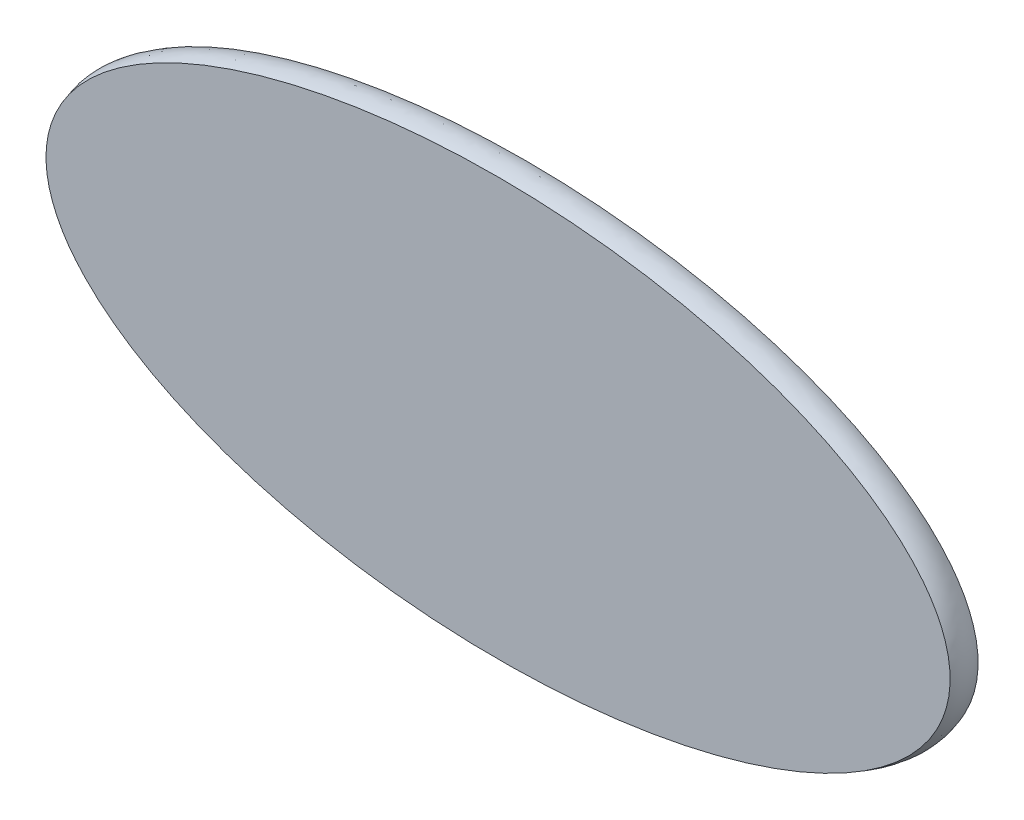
ISO-10303-21;
HEADER;
FILE_DESCRIPTION(('STEP AP214'),'2;1');
FILE_NAME('part.step','',(''),(''),'','','');
FILE_SCHEMA(('AUTOMOTIVE_DESIGN { 1 0 10303 214 1 1 1 1 }'));
ENDSEC;
DATA;
#1=APPLICATION_CONTEXT('core data for automotive mechanical design processes');
#2=APPLICATION_PROTOCOL_DEFINITION('international standard','automotive_design',2000,#1);
#3=PRODUCT_CONTEXT('',#1,'mechanical');
#4=PRODUCT('Part','Part','',(#3));
#5=PRODUCT_RELATED_PRODUCT_CATEGORY('part','',(#4));
#6=PRODUCT_DEFINITION_FORMATION('','',#4);
#7=PRODUCT_DEFINITION_CONTEXT('part definition',#1,'design');
#8=PRODUCT_DEFINITION('design','',#6,#7);
#9=PRODUCT_DEFINITION_SHAPE('','',#8);
#10=(LENGTH_UNIT() NAMED_UNIT(*) SI_UNIT(.MILLI.,.METRE.));
#11=(NAMED_UNIT(*) PLANE_ANGLE_UNIT() SI_UNIT($,.RADIAN.));
#12=(NAMED_UNIT(*) SI_UNIT($,.STERADIAN.) SOLID_ANGLE_UNIT());
#13=UNCERTAINTY_MEASURE_WITH_UNIT(LENGTH_MEASURE(1.E-05),#10,'distance_accuracy_value','');
#14=(GEOMETRIC_REPRESENTATION_CONTEXT(3) GLOBAL_UNCERTAINTY_ASSIGNED_CONTEXT((#13)) GLOBAL_UNIT_ASSIGNED_CONTEXT((#10,
#11,#12)) REPRESENTATION_CONTEXT('',''));
#15=CARTESIAN_POINT('',(0.,0.,0.));
#16=DIRECTION('',(0.,0.,1.));
#17=DIRECTION('',(1.,0.,0.));
#18=AXIS2_PLACEMENT_3D('',#15,#16,#17);
#19=CARTESIAN_POINT('',(0.,0.,5.));
#20=DIRECTION('',(0.,0.,1.));
#21=DIRECTION('',(1.,0.,0.));
#22=AXIS2_PLACEMENT_3D('',#19,#20,#21);
#23=PLANE('',#22);
#24=CARTESIAN_POINT('',(0.,37.3202862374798,5.));
#25=CARTESIAN_POINT('',(-2.13344260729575,37.3202797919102,5.));
#26=CARTESIAN_POINT('',(-4.26693449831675,37.2822529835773,5.));
#27=CARTESIAN_POINT('',(-8.53091388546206,37.1270442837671,5.));
#28=CARTESIAN_POINT('',(-10.6614016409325,37.0098697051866,4.99999999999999));
#29=CARTESIAN_POINT('',(-13.852678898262,36.7732238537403,5.));
#30=CARTESIAN_POINT('',(-14.9157989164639,36.6841829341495,5.));
#31=CARTESIAN_POINT('',(-17.0401378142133,36.4856077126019,5.));
#32=CARTESIAN_POINT('',(-18.1013566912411,36.3760733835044,5.));
#33=CARTESIAN_POINT('',(-20.2214641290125,36.1363681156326,5.));
#34=CARTESIAN_POINT('',(-21.2803526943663,36.0061972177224,5.));
#35=CARTESIAN_POINT('',(-22.8665964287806,35.7953197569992,5.));
#36=CARTESIAN_POINT('',(-23.3949992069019,35.7224232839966,5.));
#37=CARTESIAN_POINT('',(-24.4510330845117,35.5712415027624,5.));
#38=CARTESIAN_POINT('',(-24.9786641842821,35.492956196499,5.));
#39=CARTESIAN_POINT('',(-26.5604935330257,35.2499015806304,5.));
#40=CARTESIAN_POINT('',(-27.613449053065,35.0769572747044,5.));
#41=CARTESIAN_POINT('',(-29.7154122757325,34.7085497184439,5.));
#42=CARTESIAN_POINT('',(-30.7644199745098,34.5130864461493,5.));
#43=CARTESIAN_POINT('',(-32.8580186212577,34.0988346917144,5.));
#44=CARTESIAN_POINT('',(-33.9026087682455,33.8800421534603,5.));
#45=CARTESIAN_POINT('',(-35.9864410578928,33.4182881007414,5.));
#46=CARTESIAN_POINT('',(-37.0256832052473,33.1753266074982,5.));
#47=CARTESIAN_POINT('',(-39.0987774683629,32.6639154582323,5.));
#48=CARTESIAN_POINT('',(-40.132624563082,32.3954454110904,5.));
#49=CARTESIAN_POINT('',(-42.1930790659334,31.8319519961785,5.));
#50=CARTESIAN_POINT('',(-43.2196864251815,31.5369284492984,5.));
#51=CARTESIAN_POINT('',(-45.2638790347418,30.9190331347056,5.));
#52=CARTESIAN_POINT('',(-46.2814689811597,30.5961769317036,5.));
#53=CARTESIAN_POINT('',(-48.3067565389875,29.9207736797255,5.));
#54=CARTESIAN_POINT('',(-49.3144543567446,29.5682272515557,5.));
#55=CARTESIAN_POINT('',(-51.1436654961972,28.8955957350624,5.));
#56=CARTESIAN_POINT('',(-51.9670339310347,28.5805535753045,5.));
#57=CARTESIAN_POINT('',(-53.6046848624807,27.9276720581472,5.));
#58=CARTESIAN_POINT('',(-54.4189675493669,27.5898331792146,5.));
#59=CARTESIAN_POINT('',(-56.0384435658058,26.8893153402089,5.));
#60=CARTESIAN_POINT('',(-56.8436189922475,26.5265949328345,5.));
#61=CARTESIAN_POINT('',(-58.4418234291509,25.7750974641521,5.));
#62=CARTESIAN_POINT('',(-59.2348518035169,25.3863190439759,5.));
#63=CARTESIAN_POINT('',(-60.4098093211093,24.7841280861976,5.));
#64=CARTESIAN_POINT('',(-60.7971676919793,24.5812671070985,5.));
#65=CARTESIAN_POINT('',(-61.5680438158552,24.1683779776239,5.));
#66=CARTESIAN_POINT('',(-61.9515615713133,23.9583498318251,5.));
#67=CARTESIAN_POINT('',(-63.0960129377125,23.3171113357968,5.));
#68=CARTESIAN_POINT('',(-63.8507722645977,22.8747838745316,5.));
#69=CARTESIAN_POINT('',(-65.3410995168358,21.9582044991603,5.));
#70=CARTESIAN_POINT('',(-66.0766593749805,21.4839394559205,5.));
#71=CARTESIAN_POINT('',(-67.5231232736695,20.5019832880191,5.));
#72=CARTESIAN_POINT('',(-68.2340739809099,19.9943613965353,5.));
#73=CARTESIAN_POINT('',(-69.279263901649,19.2051048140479,5.));
#74=CARTESIAN_POINT('',(-69.6240829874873,18.937414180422,5.));
#75=CARTESIAN_POINT('',(-70.3059580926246,18.3922913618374,5.));
#76=CARTESIAN_POINT('',(-70.6430140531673,18.1148591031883,5.));
#77=CARTESIAN_POINT('',(-71.3082573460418,17.5499939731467,5.));
#78=CARTESIAN_POINT('',(-71.6364505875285,17.2625680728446,5.));
#79=CARTESIAN_POINT('',(-72.2832330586,16.677135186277,5.));
#80=CARTESIAN_POINT('',(-72.6018226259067,16.3791285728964,5.));
#81=CARTESIAN_POINT('',(-73.3998323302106,15.6062470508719,5.));
#82=CARTESIAN_POINT('',(-73.8719426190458,15.1237591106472,5.));
#83=CARTESIAN_POINT('',(-74.7866626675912,14.1315215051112,5.));
#84=CARTESIAN_POINT('',(-75.2292720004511,13.6217714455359,5.));
#85=CARTESIAN_POINT('',(-76.0795022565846,12.5742118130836,5.));
#86=CARTESIAN_POINT('',(-76.4871471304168,12.0364218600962,5.));
#87=CARTESIAN_POINT('',(-77.0676309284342,11.2081756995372,5.));
#88=CARTESIAN_POINT('',(-77.2559618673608,10.928499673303,5.));
#89=CARTESIAN_POINT('',(-77.621404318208,10.3618838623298,5.));
#90=CARTESIAN_POINT('',(-77.7985159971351,10.0749441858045,5.));
#91=CARTESIAN_POINT('',(-78.1122338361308,9.54190593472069,5.));
#92=CARTESIAN_POINT('',(-78.2506956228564,9.29689824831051,5.));
#93=CARTESIAN_POINT('',(-78.5184481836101,8.80195002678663,5.));
#94=CARTESIAN_POINT('',(-78.6477400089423,8.55201006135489,5.));
#95=CARTESIAN_POINT('',(-78.8966215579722,8.04738597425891,5.));
#96=CARTESIAN_POINT('',(-79.0162128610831,7.79270263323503,5.));
#97=CARTESIAN_POINT('',(-79.2452136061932,7.27870439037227,5.));
#98=CARTESIAN_POINT('',(-79.3546193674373,7.01938785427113,5.));
#99=CARTESIAN_POINT('',(-79.6664983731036,6.23545270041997,5.));
#100=CARTESIAN_POINT('',(-79.8528996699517,5.70431214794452,5.));
#101=CARTESIAN_POINT('',(-80.1783845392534,4.62783516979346,5.));
#102=CARTESIAN_POINT('',(-80.3174841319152,4.0825036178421,5.));
#103=CARTESIAN_POINT('',(-80.5074954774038,3.1614618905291,5.));
#104=CARTESIAN_POINT('',(-80.5723709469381,2.78859234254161,5.));
#105=CARTESIAN_POINT('',(-80.6780679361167,2.03941943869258,5.));
#106=CARTESIAN_POINT('',(-80.7188891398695,1.66311603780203,5.));
#107=CARTESIAN_POINT('',(-80.7757319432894,0.908674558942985,5.));
#108=CARTESIAN_POINT('',(-80.7917562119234,0.530536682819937,5.));
#109=CARTESIAN_POINT('',(-80.7985171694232,-0.225910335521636,5.));
#110=CARTESIAN_POINT('',(-80.7892576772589,-0.604219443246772,5.));
#111=CARTESIAN_POINT('',(-80.7457809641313,-1.35943227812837,5.));
#112=CARTESIAN_POINT('',(-80.7115611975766,-1.73633585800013,5.));
#113=CARTESIAN_POINT('',(-80.6188580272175,-2.48707645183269,5.));
#114=CARTESIAN_POINT('',(-80.5603773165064,-2.86091380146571,5.));
#115=CARTESIAN_POINT('',(-80.3995289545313,-3.71281602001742,5.));
#116=CARTESIAN_POINT('',(-80.2893305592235,-4.18941630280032,5.));
#117=CARTESIAN_POINT('',(-80.0322568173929,-5.13275625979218,5.));
#118=CARTESIAN_POINT('',(-79.8853659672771,-5.5994916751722,5.));
#119=CARTESIAN_POINT('',(-79.5576520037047,-6.52081714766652,5.));
#120=CARTESIAN_POINT('',(-79.3768306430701,-6.97540783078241,5.));
#121=CARTESIAN_POINT('',(-78.9840868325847,-7.87093023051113,5.));
#122=CARTESIAN_POINT('',(-78.7721632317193,-8.31186144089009,5.));
#123=CARTESIAN_POINT('',(-78.3706330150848,-9.08181046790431,5.));
#124=CARTESIAN_POINT('',(-78.186651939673,-9.4137832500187,5.));
#125=CARTESIAN_POINT('',(-77.8031047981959,-10.0686193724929,5.));
#126=CARTESIAN_POINT('',(-77.6035365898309,-10.3914814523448,5.));
#127=CARTESIAN_POINT('',(-76.9835737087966,-11.3464062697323,5.));
#128=CARTESIAN_POINT('',(-76.5419152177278,-11.9648180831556,5.));
#129=CARTESIAN_POINT('',(-75.8440597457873,-12.8658437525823,5.));
#130=CARTESIAN_POINT('',(-75.6051665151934,-13.1621726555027,5.));
#131=CARTESIAN_POINT('',(-75.1167935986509,-13.7457971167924,5.));
#132=CARTESIAN_POINT('',(-74.8673180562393,-14.033096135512,5.));
#133=CARTESIAN_POINT('',(-74.1043184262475,-14.8818976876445,5.));
#134=CARTESIAN_POINT('',(-73.5761800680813,-15.4303574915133,5.));
#135=CARTESIAN_POINT('',(-72.719206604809,-16.2675935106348,5.));
#136=CARTESIAN_POINT('',(-72.4011636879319,-16.5675860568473,5.));
#137=CARTESIAN_POINT('',(-71.7553241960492,-17.1569026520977,5.));
#138=CARTESIAN_POINT('',(-71.4275277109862,-17.4462267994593,5.));
#139=CARTESIAN_POINT('',(-70.7629414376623,-18.0147694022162,5.));
#140=CARTESIAN_POINT('',(-70.4261460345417,-18.2939812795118,5.));
#141=CARTESIAN_POINT('',(-69.7446604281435,-18.8425760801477,5.));
#142=CARTESIAN_POINT('',(-69.3999701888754,-19.1119589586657,5.));
#143=CARTESIAN_POINT('',(-68.3550243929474,-19.9061427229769,5.));
#144=CARTESIAN_POINT('',(-67.6440217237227,-20.4168701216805,5.));
#145=CARTESIAN_POINT('',(-66.1975464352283,-21.4044479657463,5.));
#146=CARTESIAN_POINT('',(-65.462040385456,-21.881249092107,5.));
#147=CARTESIAN_POINT('',(-63.9715587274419,-22.8026858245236,5.));
#148=CARTESIAN_POINT('',(-63.2165907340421,-23.2473337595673,5.));
#149=CARTESIAN_POINT('',(-62.071666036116,-23.8919203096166,5.));
#150=CARTESIAN_POINT('',(-61.6879525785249,-24.1030480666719,5.));
#151=CARTESIAN_POINT('',(-60.9166336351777,-24.5180886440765,5.));
#152=CARTESIAN_POINT('',(-60.5290281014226,-24.7220013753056,5.));
#153=CARTESIAN_POINT('',(-59.5564931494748,-25.2226656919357,5.));
#154=CARTESIAN_POINT('',(-58.9693493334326,-25.5151235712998,5.));
#155=CARTESIAN_POINT('',(-57.7879772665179,-26.0853536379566,5.));
#156=CARTESIAN_POINT('',(-57.1937487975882,-26.3631253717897,5.));
#157=CARTESIAN_POINT('',(-55.4015932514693,-27.1755612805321,5.));
#158=CARTESIAN_POINT('',(-54.1941607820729,-27.6893641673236,5.));
#159=CARTESIAN_POINT('',(-51.7607563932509,-28.6656089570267,5.));
#160=CARTESIAN_POINT('',(-50.5348122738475,-29.1281205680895,5.));
#161=CARTESIAN_POINT('',(-48.6835209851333,-29.786789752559,5.));
#162=CARTESIAN_POINT('',(-48.0643581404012,-30.0004974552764,5.));
#163=CARTESIAN_POINT('',(-46.8222737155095,-30.4167009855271,5.));
#164=CARTESIAN_POINT('',(-46.1993521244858,-30.6191967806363,5.));
#165=CARTESIAN_POINT('',(-44.3281794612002,-31.2096254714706,5.));
#166=CARTESIAN_POINT('',(-43.0748181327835,-31.5814561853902,5.));
#167=CARTESIAN_POINT('',(-40.5569231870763,-32.284921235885,5.));
#168=CARTESIAN_POINT('',(-39.2923895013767,-32.6165553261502,5.));
#169=CARTESIAN_POINT('',(-36.7536790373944,-33.242013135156,5.));
#170=CARTESIAN_POINT('',(-35.4794998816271,-33.5358271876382,5.));
#171=CARTESIAN_POINT('',(-32.9234209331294,-34.0875275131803,5.));
#172=CARTESIAN_POINT('',(-31.6415211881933,-34.3454140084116,5.));
#173=CARTESIAN_POINT('',(-29.0724369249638,-34.8265469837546,5.));
#174=CARTESIAN_POINT('',(-27.78525824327,-35.0498246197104,5.));
#175=CARTESIAN_POINT('',(-25.8505617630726,-35.3599970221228,5.));
#176=CARTESIAN_POINT('',(-25.2050006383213,-35.4592648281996,5.));
#177=CARTESIAN_POINT('',(-23.9126780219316,-35.6496808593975,5.));
#178=CARTESIAN_POINT('',(-23.2659165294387,-35.7408290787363,5.));
#179=CARTESIAN_POINT('',(-21.971467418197,-35.9152352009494,5.));
#180=CARTESIAN_POINT('',(-21.3237800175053,-35.9984947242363,5.));
#181=CARTESIAN_POINT('',(-20.0274608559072,-36.1572743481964,5.));
#182=CARTESIAN_POINT('',(-19.3788290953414,-36.2327944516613,5.));
#183=CARTESIAN_POINT('',(-17.4316597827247,-36.4477529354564,5.));
#184=CARTESIAN_POINT('',(-16.1318226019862,-36.575592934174,5.));
#185=CARTESIAN_POINT('',(-13.5299643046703,-36.8006236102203,5.));
#186=CARTESIAN_POINT('',(-12.2279440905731,-36.897824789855,5.));
#187=CARTESIAN_POINT('',(-9.6220160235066,-37.0620259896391,5.));
#188=CARTESIAN_POINT('',(-8.31810818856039,-37.1290262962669,5.));
#189=CARTESIAN_POINT('',(-5.70866024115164,-37.2333421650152,5.));
#190=CARTESIAN_POINT('',(-4.40311972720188,-37.2706477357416,5.));
#191=CARTESIAN_POINT('',(-2.44443216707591,-37.3047760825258,5.));
#192=CARTESIAN_POINT('',(-1.7914572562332,-37.3125137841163,5.));
#193=CARTESIAN_POINT('',(-0.48545497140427,-37.3208292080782,5.));
#194=CARTESIAN_POINT('',(0.167572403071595,-37.3214068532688,5.));
#195=CARTESIAN_POINT('',(1.95162451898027,-37.3132187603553,5.));
#196=CARTESIAN_POINT('',(3.08262771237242,-37.2973039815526,5.));
#197=CARTESIAN_POINT('',(5.34409911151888,-37.243498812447,5.));
#198=CARTESIAN_POINT('',(6.47456730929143,-37.205608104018,5.));
#199=CARTESIAN_POINT('',(9.86474099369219,-37.058374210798,5.));
#200=CARTESIAN_POINT('',(12.1231368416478,-36.9154695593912,5.));
#201=CARTESIAN_POINT('',(15.5044830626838,-36.6323303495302,5.));
#202=CARTESIAN_POINT('',(16.6304438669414,-36.5265010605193,5.));
#203=CARTESIAN_POINT('',(18.8799871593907,-36.291691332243,5.));
#204=CARTESIAN_POINT('',(20.003569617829,-36.1627106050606,5.));
#205=CARTESIAN_POINT('',(22.2476941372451,-35.8815436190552,5.));
#206=CARTESIAN_POINT('',(23.3682365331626,-35.7293600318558,5.));
#207=CARTESIAN_POINT('',(25.6057299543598,-35.4007281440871,5.));
#208=CARTESIAN_POINT('',(26.7226810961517,-35.2242806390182,5.));
#209=CARTESIAN_POINT('',(28.9495688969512,-34.8467927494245,5.));
#210=CARTESIAN_POINT('',(30.0595160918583,-34.6458146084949,5.));
#211=CARTESIAN_POINT('',(32.2743824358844,-34.2180202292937,5.));
#212=CARTESIAN_POINT('',(33.379301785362,-33.9912050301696,5.));
#213=CARTESIAN_POINT('',(35.5832164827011,-33.5107639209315,5.));
#214=CARTESIAN_POINT('',(36.6822122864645,-33.2571401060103,5.));
#215=CARTESIAN_POINT('',(38.8733580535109,-32.7217737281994,5.));
#216=CARTESIAN_POINT('',(39.9655079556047,-32.4400309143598,5.));
#217=CARTESIAN_POINT('',(42.1428478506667,-31.8467006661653,5.));
#218=CARTESIAN_POINT('',(43.228029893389,-31.5350839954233,5.));
#219=CARTESIAN_POINT('',(45.3889413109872,-30.880509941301,5.));
#220=CARTESIAN_POINT('',(46.4646705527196,-30.5375521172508,5.));
#221=CARTESIAN_POINT('',(48.6048439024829,-29.8182746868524,5.));
#222=CARTESIAN_POINT('',(49.6692889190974,-29.4419577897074,5.));
#223=CARTESIAN_POINT('',(51.7848467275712,-28.6535780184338,5.));
#224=CARTESIAN_POINT('',(52.8359603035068,-28.2415172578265,5.));
#225=CARTESIAN_POINT('',(54.6004290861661,-27.5121011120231,5.));
#226=CARTESIAN_POINT('',(55.3179308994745,-27.2047535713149,5.));
#227=CARTESIAN_POINT('',(56.7443124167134,-26.5706245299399,5.));
#228=CARTESIAN_POINT('',(57.4531921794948,-26.2438431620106,5.));
#229=CARTESIAN_POINT('',(58.860963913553,-25.5697001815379,5.));
#230=CARTESIAN_POINT('',(59.5598575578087,-25.2223420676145,5.));
#231=CARTESIAN_POINT('',(60.9462319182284,-24.5055663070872,5.));
#232=CARTESIAN_POINT('',(61.633713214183,-24.1361497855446,5.));
#233=CARTESIAN_POINT('',(62.8374899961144,-23.4621793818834,5.));
#234=CARTESIAN_POINT('',(63.3564959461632,-23.1624620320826,5.));
#235=CARTESIAN_POINT('',(64.3858374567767,-22.5484663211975,5.));
#236=CARTESIAN_POINT('',(64.8961730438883,-22.2341880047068,5.));
#237=CARTESIAN_POINT('',(65.9070938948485,-21.590294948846,5.));
#238=CARTESIAN_POINT('',(66.4076790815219,-21.2606800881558,5.));
#239=CARTESIAN_POINT('',(67.3978113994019,-20.5852589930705,5.));
#240=CARTESIAN_POINT('',(67.887358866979,-20.2394532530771,5.));
#241=CARTESIAN_POINT('',(68.7553719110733,-19.6029241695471,5.));
#242=CARTESIAN_POINT('',(69.1361406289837,-19.3153400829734,5.));
#243=CARTESIAN_POINT('',(69.8887950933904,-18.7287658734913,5.));
#244=CARTESIAN_POINT('',(70.260681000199,-18.4297759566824,5.));
#245=CARTESIAN_POINT('',(70.9943452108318,-17.8199621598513,5.));
#246=CARTESIAN_POINT('',(71.3561281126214,-17.5091438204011,5.));
#247=CARTESIAN_POINT('',(72.0685270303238,-16.8749342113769,5.));
#248=CARTESIAN_POINT('',(72.4191429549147,-16.5515428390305,5.));
#249=CARTESIAN_POINT('',(73.0897418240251,-15.9092554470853,5.));
#250=CARTESIAN_POINT('',(73.4103639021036,-15.5910274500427,5.));
#251=CARTESIAN_POINT('',(74.0392438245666,-14.9425964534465,5.));
#252=CARTESIAN_POINT('',(74.3475023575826,-14.6123941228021,5.));
#253=CARTESIAN_POINT('',(74.9508109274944,-13.9390556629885,5.));
#254=CARTESIAN_POINT('',(75.2458369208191,-13.5958979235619,5.));
#255=CARTESIAN_POINT('',(75.8204697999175,-12.8969119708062,5.));
#256=CARTESIAN_POINT('',(76.1000762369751,-12.541083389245,5.));
#257=CARTESIAN_POINT('',(76.7801860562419,-11.6317916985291,5.));
#258=CARTESIAN_POINT('',(77.1697213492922,-11.0699853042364,5.));
#259=CARTESIAN_POINT('',(77.7189238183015,-10.2050263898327,5.));
#260=CARTESIAN_POINT('',(77.8961719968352,-9.91294010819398,5.));
#261=CARTESIAN_POINT('',(78.23788488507,-9.32139801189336,5.));
#262=CARTESIAN_POINT('',(78.4023496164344,-9.02194220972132,5.));
#263=CARTESIAN_POINT('',(78.8744310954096,-8.11372987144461,5.));
#264=CARTESIAN_POINT('',(79.1614749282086,-7.49397580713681,5.));
#265=CARTESIAN_POINT('',(79.5447694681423,-6.54563738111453,5.));
#266=CARTESIAN_POINT('',(79.6646543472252,-6.2264115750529,5.));
#267=CARTESIAN_POINT('',(79.8877767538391,-5.58219845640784,5.));
#268=CARTESIAN_POINT('',(79.9910158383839,-5.25721168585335,5.));
#269=CARTESIAN_POINT('',(80.222852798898,-4.45325903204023,5.));
#270=CARTESIAN_POINT('',(80.3416589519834,-3.97142400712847,5.));
#271=CARTESIAN_POINT('',(80.5394720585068,-2.99974444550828,5.));
#272=CARTESIAN_POINT('',(80.6184862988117,-2.50990139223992,5.));
#273=CARTESIAN_POINT('',(80.7346339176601,-1.52550141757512,5.));
#274=CARTESIAN_POINT('',(80.7717961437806,-1.03094798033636,5.));
#275=CARTESIAN_POINT('',(80.7951745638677,-0.288218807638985,5.));
#276=CARTESIAN_POINT('',(80.7975715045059,-0.0404617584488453,5.));
#277=CARTESIAN_POINT('',(80.7915403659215,0.454920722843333,5.));
#278=CARTESIAN_POINT('',(80.7831123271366,0.702546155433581,5.));
#279=CARTESIAN_POINT('',(80.7417784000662,1.44425386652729,5.));
#280=CARTESIAN_POINT('',(80.6928335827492,1.9375217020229,5.));
#281=CARTESIAN_POINT('',(80.5536838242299,2.91820476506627,5.));
#282=CARTESIAN_POINT('',(80.4634743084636,3.4056193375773,5.));
#283=CARTESIAN_POINT('',(80.2988940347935,4.13020747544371,5.));
#284=CARTESIAN_POINT('',(80.2391127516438,4.37078663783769,5.));
#285=CARTESIAN_POINT('',(80.1101324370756,4.84933628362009,5.));
#286=CARTESIAN_POINT('',(80.040936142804,5.08730750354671,5.));
#287=CARTESIAN_POINT('',(79.8196899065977,5.79702182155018,5.));
#288=CARTESIAN_POINT('',(79.6539867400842,6.26454757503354,5.));
#289=CARTESIAN_POINT('',(79.2270541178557,7.34300199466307,5.));
#290=CARTESIAN_POINT('',(78.9524968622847,7.94868394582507,5.));
#291=CARTESIAN_POINT('',(78.5009468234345,8.83676530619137,5.));
#292=CARTESIAN_POINT('',(78.3437584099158,9.12946958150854,5.));
#293=CARTESIAN_POINT('',(78.0170515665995,9.70792300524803,5.));
#294=CARTESIAN_POINT('',(77.8475331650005,9.99367216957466,5.));
#295=CARTESIAN_POINT('',(77.3216216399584,10.8410206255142,5.));
#296=CARTESIAN_POINT('',(76.9481862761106,11.3921108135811,5.));
#297=CARTESIAN_POINT('',(76.1631884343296,12.4660853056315,5.));
#298=CARTESIAN_POINT('',(75.7516299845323,12.9889725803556,5.));
#299=CARTESIAN_POINT('',(74.9812368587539,13.9061781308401,5.));
#300=CARTESIAN_POINT('',(74.628188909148,14.3053886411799,5.));
#301=CARTESIAN_POINT('',(73.9038032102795,15.0868583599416,5.));
#302=CARTESIAN_POINT('',(73.5324646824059,15.4691168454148,5.));
#303=CARTESIAN_POINT('',(72.7741421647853,16.2167851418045,5.));
#304=CARTESIAN_POINT('',(72.3871781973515,16.5822153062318,5.));
#305=CARTESIAN_POINT('',(71.598929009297,17.2972952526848,5.));
#306=CARTESIAN_POINT('',(71.1976428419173,17.6469439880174,5.));
#307=CARTESIAN_POINT('',(70.1830328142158,18.4986733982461,5.));
#308=CARTESIAN_POINT('',(69.5620338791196,18.9916267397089,5.));
#309=CARTESIAN_POINT('',(68.2968851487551,19.9468798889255,5.));
#310=CARTESIAN_POINT('',(67.6527320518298,20.4091752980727,5.));
#311=CARTESIAN_POINT('',(66.3444603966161,21.305696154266,5.));
#312=CARTESIAN_POINT('',(65.6803260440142,21.7398984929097,5.));
#313=CARTESIAN_POINT('',(64.3355528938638,22.5817903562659,5.));
#314=CARTESIAN_POINT('',(63.6549149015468,22.9894811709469,5.));
#315=CARTESIAN_POINT('',(62.2816333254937,23.7787561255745,5.));
#316=CARTESIAN_POINT('',(61.5890358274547,24.1604206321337,5.));
#317=CARTESIAN_POINT('',(60.1915929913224,24.9005736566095,5.));
#318=CARTESIAN_POINT('',(59.4867476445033,25.2590621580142,5.));
#319=CARTESIAN_POINT('',(58.0667587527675,25.9543470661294,5.));
#320=CARTESIAN_POINT('',(57.3516188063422,26.2911508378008,5.));
#321=CARTESIAN_POINT('',(55.9121343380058,26.9445065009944,5.));
#322=CARTESIAN_POINT('',(55.1877895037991,27.2610577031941,5.));
#323=CARTESIAN_POINT('',(53.7463928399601,27.8685877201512,5.));
#324=CARTESIAN_POINT('',(53.0295085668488,28.1599646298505,5.));
#325=CARTESIAN_POINT('',(51.588909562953,28.7253416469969,5.));
#326=CARTESIAN_POINT('',(50.865194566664,28.9993410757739,5.));
#327=CARTESIAN_POINT('',(48.6847719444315,29.7965174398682,5.));
#328=CARTESIAN_POINT('',(47.2189106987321,30.2948205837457,5.));
#329=CARTESIAN_POINT('',(44.267047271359,31.2312933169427,5.));
#330=CARTESIAN_POINT('',(42.7810305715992,31.6694167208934,5.));
#331=CARTESIAN_POINT('',(39.7937354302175,32.4897281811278,5.));
#332=CARTESIAN_POINT('',(38.2924578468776,32.8719193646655,4.99999999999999));
#333=CARTESIAN_POINT('',(36.0380428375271,33.4044126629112,5.));
#334=CARTESIAN_POINT('',(35.2894990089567,33.5744425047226,5.));
#335=CARTESIAN_POINT('',(33.7896938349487,33.9020658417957,5.));
#336=CARTESIAN_POINT('',(33.0384324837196,34.0596593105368,5.));
#337=CARTESIAN_POINT('',(30.780983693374,34.5142647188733,5.));
#338=CARTESIAN_POINT('',(29.2710903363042,34.7931113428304,5.));
#339=CARTESIAN_POINT('',(27.0007759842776,35.1766959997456,5.));
#340=CARTESIAN_POINT('',(26.2432177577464,35.2987593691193,5.));
#341=CARTESIAN_POINT('',(24.7263579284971,35.5316139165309,5.));
#342=CARTESIAN_POINT('',(23.9670563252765,35.6424050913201,5.));
#343=CARTESIAN_POINT('',(22.8269670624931,35.800304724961,5.));
#344=CARTESIAN_POINT('',(22.4467471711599,35.8515568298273,5.));
#345=CARTESIAN_POINT('',(21.6859556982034,35.9513815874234,5.));
#346=CARTESIAN_POINT('',(21.3053841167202,35.9999542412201,5.));
#347=CARTESIAN_POINT('',(20.1631703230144,36.1416503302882,5.));
#348=CARTESIAN_POINT('',(19.4010256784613,36.2307523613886,5.00000000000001));
#349=CARTESIAN_POINT('',(17.8648195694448,36.3994673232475,5.00000000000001));
#350=CARTESIAN_POINT('',(17.0907414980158,36.4789288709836,5.));
#351=CARTESIAN_POINT('',(15.5415527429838,36.6269408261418,5.));
#352=CARTESIAN_POINT('',(14.7664420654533,36.6954912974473,5.));
#353=CARTESIAN_POINT('',(12.4397936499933,36.8848820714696,5.));
#354=CARTESIAN_POINT('',(10.8869023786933,36.9894658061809,5.));
#355=CARTESIAN_POINT('',(7.77890510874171,37.155978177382,5.));
#356=CARTESIAN_POINT('',(6.22379917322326,37.2179080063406,5.));
#357=CARTESIAN_POINT('',(3.11247091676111,37.3000648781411,5.));
#358=CARTESIAN_POINT('',(1.55624857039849,37.3202909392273,5.));
#359=CARTESIAN_POINT('',(0.,37.3202862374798,5.));
#360=B_SPLINE_CURVE_WITH_KNOTS('',3,(#24,#25,#26,#27,#28,#29,#30,#31,#32,#33,#34,#35,#36,#37,
#38,#39,#40,#41,#42,#43,#44,#45,#46,#47,#48,#49,#50,#51,#52,#53,#54,#55,#56,#57,#58,#59,#60,#61,
#62,#63,#64,#65,#66,#67,#68,#69,#70,#71,#72,#73,#74,#75,#76,#77,#78,#79,#80,#81,#82,#83,#84,#85,
#86,#87,#88,#89,#90,#91,#92,#93,#94,#95,#96,#97,#98,#99,#100,#101,#102,#103,#104,#105,#106,#107,
#108,#109,#110,#111,#112,#113,#114,#115,#116,#117,#118,#119,#120,#121,#122,#123,#124,#125,#126,
#127,#128,#129,#130,#131,#132,#133,#134,#135,#136,#137,#138,#139,#140,#141,#142,#143,#144,#145,
#146,#147,#148,#149,#150,#151,#152,#153,#154,#155,#156,#157,#158,#159,#160,#161,#162,#163,#164,
#165,#166,#167,#168,#169,#170,#171,#172,#173,#174,#175,#176,#177,#178,#179,#180,#181,#182,#183,
#184,#185,#186,#187,#188,#189,#190,#191,#192,#193,#194,#195,#196,#197,#198,#199,#200,#201,#202,
#203,#204,#205,#206,#207,#208,#209,#210,#211,#212,#213,#214,#215,#216,#217,#218,#219,#220,#221,
#222,#223,#224,#225,#226,#227,#228,#229,#230,#231,#232,#233,#234,#235,#236,#237,#238,#239,#240,
#241,#242,#243,#244,#245,#246,#247,#248,#249,#250,#251,#252,#253,#254,#255,#256,#257,#258,#259,
#260,#261,#262,#263,#264,#265,#266,#267,#268,#269,#270,#271,#272,#273,#274,#275,#276,#277,#278,
#279,#280,#281,#282,#283,#284,#285,#286,#287,#288,#289,#290,#291,#292,#293,#294,#295,#296,#297,
#298,#299,#300,#301,#302,#303,#304,#305,#306,#307,#308,#309,#310,#311,#312,#313,#314,#315,#316,
#317,#318,#319,#320,#321,#322,#323,#324,#325,#326,#327,#328,#329,#330,#331,#332,#333,#334,#335,
#336,#337,#338,#339,#340,#341,#342,#343,#344,#345,#346,#347,#348,#349,#350,#351,#352,#353,#354,
#355,#356,#357,#358,#359),.UNSPECIFIED.,.T.,.F.,(4,2,2,2,2,2,2,2,2,2,2,2,2,2,2,2,2,2,2,2,2,2,2,
2,2,2,2,2,2,2,2,2,2,2,2,2,2,2,2,2,2,2,2,2,2,2,2,2,2,2,2,2,2,2,2,2,2,2,2,2,2,2,2,2,2,2,2,2,2,2,2,
2,2,2,2,2,2,2,2,2,2,2,2,2,2,2,2,2,2,2,2,2,2,2,2,2,2,2,2,2,2,2,2,2,2,2,2,2,2,2,2,2,2,2,2,2,2,2,2,
2,2,2,2,2,2,2,2,2,2,2,2,2,2,2,2,2,2,2,2,2,2,2,2,2,2,2,2,2,2,2,2,2,2,2,2,2,2,2,2,2,2,2,2,2,2,2,2,
4),(0.,6.40006750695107,12.7995437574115,15.9999053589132,19.2002711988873,22.4006307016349,
24.0008289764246,25.6010266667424,28.8019629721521,32.0029023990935,35.2043992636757,
38.4058933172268,41.6099684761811,44.8140652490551,48.0163816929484,51.2186311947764,
53.8630684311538,56.5074501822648,59.1563492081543,61.8053864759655,63.1171097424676,
64.4288321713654,67.0525206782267,69.6772944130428,72.2967826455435,73.6062274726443,
74.9156822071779,76.2242411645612,77.532754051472,79.5567396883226,81.5807546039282,
83.6033718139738,84.614683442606,85.6259800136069,86.4700801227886,87.3140833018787,
88.1579487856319,89.0021180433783,90.6886652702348,92.3746407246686,93.5093467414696,
94.6440676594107,95.7786664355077,96.9130938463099,98.0476369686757,99.1820541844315,
100.647961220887,102.114488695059,103.58094043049,105.047446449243,106.185635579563,
107.323981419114,109.600637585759,110.742352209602,111.883623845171,114.165966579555,
115.477390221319,116.788801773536,118.101051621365,119.413307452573,122.038321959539,
124.667077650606,127.294819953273,128.60864465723,129.922485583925,131.890097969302,
133.857771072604,137.792998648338,141.722810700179,143.687737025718,145.652669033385,
149.573937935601,153.495230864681,157.417524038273,161.339792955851,165.258510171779,
167.217914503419,169.17732023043,171.136322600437,173.09532426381,177.0132501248,
180.929831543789,184.846375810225,188.764237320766,190.723265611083,192.682315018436,
196.075420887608,199.468575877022,206.255121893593,209.647710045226,213.040340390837,
216.432580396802,219.824709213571,223.208403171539,226.591961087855,229.975254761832,
233.358578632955,236.745248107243,240.131965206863,243.518407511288,246.90464971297,
249.246072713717,251.587479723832,253.928489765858,256.269380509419,258.067158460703,
259.864930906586,261.662717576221,263.460449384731,264.891757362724,266.323039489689,
267.753659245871,269.184290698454,270.53920108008,271.894035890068,273.251240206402,
274.608483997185,276.657094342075,277.681794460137,278.706492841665,280.751794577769,
281.774415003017,282.796939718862,284.284070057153,285.770927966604,287.256760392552,
287.999861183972,288.742959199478,290.228095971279,291.713397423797,292.456918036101,
293.200222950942,294.686888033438,296.678658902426,297.675137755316,298.671614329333,
300.66661961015,302.661414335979,304.259592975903,305.857839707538,307.454099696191,
309.050465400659,311.427943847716,313.805762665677,316.185513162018,318.56514778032,
320.937066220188,323.308986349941,325.68009658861,328.051287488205,330.3725530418,
332.693909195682,337.337024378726,341.983683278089,346.630082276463,348.932829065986,
351.235580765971,355.84095731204,358.142885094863,360.444813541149,361.595781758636,
362.746749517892,365.0486747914,367.383032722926,369.717376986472,374.385953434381,
379.054399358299,383.722955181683),.UNSPECIFIED.);
#361=CARTESIAN_POINT('',(0.,37.3202862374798,5.));
#362=VERTEX_POINT('',#361);
#363=EDGE_CURVE('E106',#362,#362,#360,.T.);
#364=ORIENTED_EDGE('',*,*,#363,.T.);
#365=EDGE_LOOP('',(#364));
#366=FACE_BOUND('',#365,.T.);
#367=ADVANCED_FACE('F102',(#366),#23,.T.);
#368=CARTESIAN_POINT('',(0.,35.712618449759,-2.25366348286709));
#369=CARTESIAN_POINT('',(1.00002073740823,35.712618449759,-2.25366348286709));
#370=CARTESIAN_POINT('',(2.35988274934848,35.7013834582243,-2.25366348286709));
#371=CARTESIAN_POINT('',(9.32859615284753,35.5596610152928,-2.25366348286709));
#372=CARTESIAN_POINT('',(15.8552176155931,35.1173352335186,-2.25366348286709));
#373=CARTESIAN_POINT('',(26.5037786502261,33.6822424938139,-2.25366348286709));
#374=CARTESIAN_POINT('',(30.7518523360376,32.9455301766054,-2.25366348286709));
#375=CARTESIAN_POINT('',(39.3535235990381,31.0085029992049,-2.25366348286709));
#376=CARTESIAN_POINT('',(43.7075781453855,29.8070900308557,-2.25366348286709));
#377=CARTESIAN_POINT('',(52.1948815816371,26.8671814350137,-2.25366348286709));
#378=CARTESIAN_POINT('',(56.3269017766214,25.1272630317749,-2.25366348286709));
#379=CARTESIAN_POINT('',(63.9161211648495,21.1096286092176,-2.25366348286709));
#380=CARTESIAN_POINT('',(67.3696522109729,18.8308408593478,-2.25366348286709));
#381=CARTESIAN_POINT('',(71.3852357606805,15.3537955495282,-2.25366348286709));
#382=CARTESIAN_POINT('',(73.4908744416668,13.3014616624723,-2.25366348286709));
#383=CARTESIAN_POINT('',(75.5962487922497,10.611884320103,-2.25366348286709));
#384=CARTESIAN_POINT('',(76.5973137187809,8.96457903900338,-2.25366348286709));
#385=CARTESIAN_POINT('',(77.2046663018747,7.85996356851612,-2.25366348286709));
#386=CARTESIAN_POINT('',(78.0251668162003,6.1936721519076,-2.25366348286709));
#387=CARTESIAN_POINT('',(78.9412300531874,3.38222906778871,-2.25366348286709));
#388=CARTESIAN_POINT('',(79.1881515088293,1.12756672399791,-2.25366348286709));
#389=CARTESIAN_POINT('',(79.1881515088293,-1.12756672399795,-2.25366348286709));
#390=CARTESIAN_POINT('',(78.9412300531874,-3.38222906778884,-2.25366348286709));
#391=CARTESIAN_POINT('',(78.0251668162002,-6.19367215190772,-2.25366348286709));
#392=CARTESIAN_POINT('',(77.2046663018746,-7.85996356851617,-2.25366348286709));
#393=CARTESIAN_POINT('',(76.5973137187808,-8.96457903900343,-2.25366348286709));
#394=CARTESIAN_POINT('',(75.5962487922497,-10.611884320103,-2.25366348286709));
#395=CARTESIAN_POINT('',(73.4908744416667,-13.3014616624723,-2.25366348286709));
#396=CARTESIAN_POINT('',(71.3852357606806,-15.3537955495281,-2.25366348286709));
#397=CARTESIAN_POINT('',(67.3696522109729,-18.8308408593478,-2.25366348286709));
#398=CARTESIAN_POINT('',(63.9161211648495,-21.1096286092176,-2.25366348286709));
#399=CARTESIAN_POINT('',(56.3269017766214,-25.1272630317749,-2.25366348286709));
#400=CARTESIAN_POINT('',(52.1948815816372,-26.8671814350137,-2.25366348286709));
#401=CARTESIAN_POINT('',(43.7075781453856,-29.8070900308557,-2.25366348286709));
#402=CARTESIAN_POINT('',(39.3535235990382,-31.0085029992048,-2.25366348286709));
#403=CARTESIAN_POINT('',(30.7518523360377,-32.9455301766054,-2.25366348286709));
#404=CARTESIAN_POINT('',(26.5037786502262,-33.6822424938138,-2.25366348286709));
#405=CARTESIAN_POINT('',(15.8552176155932,-35.1173352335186,-2.25366348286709));
#406=CARTESIAN_POINT('',(9.32859615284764,-35.5596610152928,-2.25366348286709));
#407=CARTESIAN_POINT('',(3.05675408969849,-35.6872112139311,-2.25366348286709));
#408=CARTESIAN_POINT('',(1.67995174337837,-35.7070009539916,-2.25366348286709));
#409=CARTESIAN_POINT('',(0.666680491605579,-35.712618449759,-2.25366348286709));
#410=CARTESIAN_POINT('',(-0.66668049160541,-35.712618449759,-2.25366348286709));
#411=CARTESIAN_POINT('',(-1.6799517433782,-35.7070009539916,-2.25366348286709));
#412=CARTESIAN_POINT('',(-3.05675408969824,-35.6872112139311,-2.25366348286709));
#413=CARTESIAN_POINT('',(-9.32859615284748,-35.5596610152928,-2.25366348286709));
#414=CARTESIAN_POINT('',(-15.855217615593,-35.1173352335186,-2.25366348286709));
#415=CARTESIAN_POINT('',(-26.503778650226,-33.6822424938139,-2.25366348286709));
#416=CARTESIAN_POINT('',(-30.7518523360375,-32.9455301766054,-2.25366348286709));
#417=CARTESIAN_POINT('',(-39.353523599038,-31.0085029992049,-2.25366348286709));
#418=CARTESIAN_POINT('',(-43.7075781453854,-29.8070900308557,-2.25366348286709));
#419=CARTESIAN_POINT('',(-52.1948815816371,-26.8671814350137,-2.25366348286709));
#420=CARTESIAN_POINT('',(-56.3269017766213,-25.1272630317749,-2.25366348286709));
#421=CARTESIAN_POINT('',(-63.9161211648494,-21.1096286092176,-2.25366348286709));
#422=CARTESIAN_POINT('',(-67.3696522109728,-18.8308408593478,-2.25366348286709));
#423=CARTESIAN_POINT('',(-71.3852357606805,-15.3537955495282,-2.25366348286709));
#424=CARTESIAN_POINT('',(-73.4908744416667,-13.3014616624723,-2.25366348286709));
#425=CARTESIAN_POINT('',(-75.5962487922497,-10.611884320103,-2.25366348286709));
#426=CARTESIAN_POINT('',(-76.5973137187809,-8.96457903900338,-2.25366348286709));
#427=CARTESIAN_POINT('',(-77.2046663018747,-7.85996356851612,-2.25366348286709));
#428=CARTESIAN_POINT('',(-78.0251668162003,-6.19367215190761,-2.25366348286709));
#429=CARTESIAN_POINT('',(-78.9412300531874,-3.38222906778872,-2.25366348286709));
#430=CARTESIAN_POINT('',(-79.1881515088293,-1.12756672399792,-2.25366348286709));
#431=CARTESIAN_POINT('',(-79.1881515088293,1.12756672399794,-2.25366348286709));
#432=CARTESIAN_POINT('',(-78.9412300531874,3.38222906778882,-2.25366348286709));
#433=CARTESIAN_POINT('',(-78.0251668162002,6.19367215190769,-2.25366348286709));
#434=CARTESIAN_POINT('',(-77.2046663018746,7.85996356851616,-2.25366348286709));
#435=CARTESIAN_POINT('',(-76.5973137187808,8.96457903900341,-2.25366348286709));
#436=CARTESIAN_POINT('',(-75.5962487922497,10.6118843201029,-2.25366348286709));
#437=CARTESIAN_POINT('',(-73.4908744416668,13.3014616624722,-2.25366348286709));
#438=CARTESIAN_POINT('',(-71.3852357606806,15.3537955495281,-2.25366348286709));
#439=CARTESIAN_POINT('',(-67.3696522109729,18.8308408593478,-2.25366348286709));
#440=CARTESIAN_POINT('',(-63.9161211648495,21.1096286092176,-2.25366348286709));
#441=CARTESIAN_POINT('',(-56.3269017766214,25.1272630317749,-2.25366348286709));
#442=CARTESIAN_POINT('',(-52.1948815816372,26.8671814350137,-2.25366348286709));
#443=CARTESIAN_POINT('',(-43.7075781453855,29.8070900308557,-2.25366348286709));
#444=CARTESIAN_POINT('',(-39.3535235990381,31.0085029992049,-2.25366348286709));
#445=CARTESIAN_POINT('',(-30.7518523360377,32.9455301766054,-2.25366348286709));
#446=CARTESIAN_POINT('',(-26.5037786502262,33.6822424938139,-2.25366348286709));
#447=CARTESIAN_POINT('',(-15.8552176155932,35.1173352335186,-2.25366348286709));
#448=CARTESIAN_POINT('',(-9.32859615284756,35.5596610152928,-2.25366348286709));
#449=CARTESIAN_POINT('',(-3.05675408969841,35.6872112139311,-2.25366348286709));
#450=CARTESIAN_POINT('',(-1.67995174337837,35.7070009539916,-2.25366348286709));
#451=CARTESIAN_POINT('',(-0.666680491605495,35.712618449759,-2.25366348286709));
#452=CARTESIAN_POINT('',(0.,35.712618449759,-2.25366348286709));
#453=CARTESIAN_POINT('',(0.,38.828982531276,0.552401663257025));
#454=CARTESIAN_POINT('',(1.01926361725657,38.828982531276,0.552401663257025));
#455=CARTESIAN_POINT('',(2.40478280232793,38.8175335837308,0.552401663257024));
#456=CARTESIAN_POINT('',(9.50271898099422,38.6731197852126,0.552401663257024));
#457=CARTESIAN_POINT('',(16.1436925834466,38.2224133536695,0.552401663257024));
#458=CARTESIAN_POINT('',(26.9996246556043,36.7603190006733,0.552401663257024));
#459=CARTESIAN_POINT('',(31.3352640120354,36.0098117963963,0.552401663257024));
#460=CARTESIAN_POINT('',(40.1356313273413,34.0282338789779,0.552401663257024));
#461=CARTESIAN_POINT('',(44.6008162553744,32.7960650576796,0.552401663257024));
#462=CARTESIAN_POINT('',(53.3418947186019,29.7675421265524,0.552401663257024));
#463=CARTESIAN_POINT('',(57.6165595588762,27.9697652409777,0.552401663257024));
#464=CARTESIAN_POINT('',(65.5420716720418,23.775858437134,0.552401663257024));
#465=CARTESIAN_POINT('',(69.1892507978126,21.3786567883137,0.552401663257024));
#466=CARTESIAN_POINT('',(73.5136915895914,17.6326319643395,0.552401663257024));
#467=CARTESIAN_POINT('',(75.8044486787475,15.403006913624,0.552401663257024));
#468=CARTESIAN_POINT('',(78.1457483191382,12.4182985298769,0.552401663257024));
#469=CARTESIAN_POINT('',(79.2842015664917,10.5454608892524,0.552401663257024));
#470=CARTESIAN_POINT('',(79.9795367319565,9.28079417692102,0.552401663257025));
#471=CARTESIAN_POINT('',(80.9265966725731,7.35988139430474,0.552401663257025));
#472=CARTESIAN_POINT('',(82.0063925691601,4.05938055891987,0.552401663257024));
#473=CARTESIAN_POINT('',(82.3045155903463,1.35328388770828,0.552401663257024));
#474=CARTESIAN_POINT('',(82.3045155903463,-1.35328388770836,0.552401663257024));
#475=CARTESIAN_POINT('',(82.0063925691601,-4.05938055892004,0.552401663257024));
#476=CARTESIAN_POINT('',(80.926596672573,-7.35988139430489,0.552401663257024));
#477=CARTESIAN_POINT('',(79.9795367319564,-9.28079417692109,0.552401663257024));
#478=CARTESIAN_POINT('',(79.2842015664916,-10.5454608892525,0.552401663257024));
#479=CARTESIAN_POINT('',(78.1457483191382,-12.4182985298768,0.552401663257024));
#480=CARTESIAN_POINT('',(75.8044486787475,-15.403006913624,0.552401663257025));
#481=CARTESIAN_POINT('',(73.5136915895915,-17.6326319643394,0.552401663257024));
#482=CARTESIAN_POINT('',(69.1892507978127,-21.3786567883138,0.552401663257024));
#483=CARTESIAN_POINT('',(65.5420716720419,-23.775858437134,0.552401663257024));
#484=CARTESIAN_POINT('',(57.6165595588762,-27.9697652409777,0.552401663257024));
#485=CARTESIAN_POINT('',(53.341894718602,-29.7675421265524,0.552401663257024));
#486=CARTESIAN_POINT('',(44.6008162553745,-32.7960650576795,0.552401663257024));
#487=CARTESIAN_POINT('',(40.1356313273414,-34.0282338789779,0.552401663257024));
#488=CARTESIAN_POINT('',(31.3352640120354,-36.0098117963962,0.552401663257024));
#489=CARTESIAN_POINT('',(26.9996246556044,-36.7603190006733,0.552401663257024));
#490=CARTESIAN_POINT('',(16.1436925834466,-38.2224133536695,0.552401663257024));
#491=CARTESIAN_POINT('',(9.50271898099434,-38.6731197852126,0.552401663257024));
#492=CARTESIAN_POINT('',(3.11457642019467,-38.803092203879,0.552401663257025));
#493=CARTESIAN_POINT('',(1.71202320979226,-38.8232580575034,0.552401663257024));
#494=CARTESIAN_POINT('',(0.679509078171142,-38.828982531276,0.552401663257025));
#495=CARTESIAN_POINT('',(-0.67950907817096,-38.828982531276,0.552401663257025));
#496=CARTESIAN_POINT('',(-1.71202320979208,-38.8232580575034,0.552401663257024));
#497=CARTESIAN_POINT('',(-3.11457642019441,-38.803092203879,0.552401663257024));
#498=CARTESIAN_POINT('',(-9.50271898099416,-38.6731197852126,0.552401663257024));
#499=CARTESIAN_POINT('',(-16.1436925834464,-38.2224133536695,0.552401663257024));
#500=CARTESIAN_POINT('',(-26.9996246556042,-36.7603190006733,0.552401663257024));
#501=CARTESIAN_POINT('',(-31.3352640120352,-36.0098117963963,0.552401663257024));
#502=CARTESIAN_POINT('',(-40.1356313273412,-34.0282338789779,0.552401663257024));
#503=CARTESIAN_POINT('',(-44.6008162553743,-32.7960650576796,0.552401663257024));
#504=CARTESIAN_POINT('',(-53.3418947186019,-29.7675421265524,0.552401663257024));
#505=CARTESIAN_POINT('',(-57.6165595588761,-27.9697652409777,0.552401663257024));
#506=CARTESIAN_POINT('',(-65.5420716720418,-23.775858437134,0.552401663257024));
#507=CARTESIAN_POINT('',(-69.1892507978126,-21.3786567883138,0.552401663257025));
#508=CARTESIAN_POINT('',(-73.5136915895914,-17.6326319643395,0.552401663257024));
#509=CARTESIAN_POINT('',(-75.8044486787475,-15.403006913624,0.552401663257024));
#510=CARTESIAN_POINT('',(-78.1457483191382,-12.4182985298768,0.552401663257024));
#511=CARTESIAN_POINT('',(-79.2842015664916,-10.5454608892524,0.552401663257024));
#512=CARTESIAN_POINT('',(-79.9795367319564,-9.28079417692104,0.552401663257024));
#513=CARTESIAN_POINT('',(-80.926596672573,-7.35988139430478,0.552401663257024));
#514=CARTESIAN_POINT('',(-82.0063925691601,-4.05938055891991,0.552401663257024));
#515=CARTESIAN_POINT('',(-82.3045155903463,-1.3532838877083,0.552401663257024));
#516=CARTESIAN_POINT('',(-82.3045155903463,1.35328388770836,0.552401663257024));
#517=CARTESIAN_POINT('',(-82.0063925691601,4.05938055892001,0.552401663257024));
#518=CARTESIAN_POINT('',(-80.9265966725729,7.35988139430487,0.552401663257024));
#519=CARTESIAN_POINT('',(-79.9795367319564,9.28079417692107,0.552401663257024));
#520=CARTESIAN_POINT('',(-79.2842015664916,10.5454608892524,0.552401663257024));
#521=CARTESIAN_POINT('',(-78.1457483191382,12.4182985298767,0.552401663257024));
#522=CARTESIAN_POINT('',(-75.8044486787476,15.4030069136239,0.552401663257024));
#523=CARTESIAN_POINT('',(-73.5136915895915,17.6326319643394,0.552401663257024));
#524=CARTESIAN_POINT('',(-69.1892507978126,21.3786567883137,0.552401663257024));
#525=CARTESIAN_POINT('',(-65.5420716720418,23.775858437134,0.552401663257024));
#526=CARTESIAN_POINT('',(-57.6165595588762,27.9697652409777,0.552401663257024));
#527=CARTESIAN_POINT('',(-53.3418947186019,29.7675421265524,0.552401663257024));
#528=CARTESIAN_POINT('',(-44.6008162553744,32.7960650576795,0.552401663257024));
#529=CARTESIAN_POINT('',(-40.1356313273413,34.0282338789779,0.552401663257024));
#530=CARTESIAN_POINT('',(-31.3352640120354,36.0098117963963,0.552401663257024));
#531=CARTESIAN_POINT('',(-26.9996246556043,36.7603190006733,0.552401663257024));
#532=CARTESIAN_POINT('',(-16.1436925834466,38.2224133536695,0.552401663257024));
#533=CARTESIAN_POINT('',(-9.50271898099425,38.6731197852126,0.552401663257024));
#534=CARTESIAN_POINT('',(-3.11457642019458,38.803092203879,0.552401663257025));
#535=CARTESIAN_POINT('',(-1.71202320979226,38.8232580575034,0.552401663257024));
#536=CARTESIAN_POINT('',(-0.679509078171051,38.828982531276,0.552401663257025));
#537=CARTESIAN_POINT('',(0.,38.828982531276,0.552401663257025));
#538=CARTESIAN_POINT('',(0.,38.7441861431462,4.74507816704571));
#539=CARTESIAN_POINT('',(1.01874001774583,38.7441861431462,4.74507816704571));
#540=CARTESIAN_POINT('',(2.40356107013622,38.7327430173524,4.74507816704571));
#541=CARTESIAN_POINT('',(9.49798109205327,38.5884024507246,4.74507816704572));
#542=CARTESIAN_POINT('',(16.1358431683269,38.1379240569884,4.74507816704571));
#543=CARTESIAN_POINT('',(26.9861326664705,36.6765644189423,4.74507816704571));
#544=CARTESIAN_POINT('',(31.3193893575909,35.9264325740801,4.74507816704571));
#545=CARTESIAN_POINT('',(40.1143501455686,33.9460668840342,4.74507816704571));
#546=CARTESIAN_POINT('',(44.5765112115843,32.7147349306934,4.74507816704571));
#547=CARTESIAN_POINT('',(53.310684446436,29.6886231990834,4.74507816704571));
#548=CARTESIAN_POINT('',(57.5814679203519,27.8924206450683,4.74507816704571));
#549=CARTESIAN_POINT('',(65.4978294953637,23.7033102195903,4.74507816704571));
#550=CARTESIAN_POINT('',(69.1397394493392,21.3093306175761,4.74507816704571));
#551=CARTESIAN_POINT('',(73.4557762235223,17.5706247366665,4.74507816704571));
#552=CARTESIAN_POINT('',(75.7414962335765,15.3458237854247,4.74507816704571));
#553=CARTESIAN_POINT('',(78.0763763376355,12.3691459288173,4.74507816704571));
#554=CARTESIAN_POINT('',(79.2110912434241,10.5024450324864,4.74507816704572));
#555=CARTESIAN_POINT('',(79.9040323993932,9.24213332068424,4.74507816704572));
#556=CARTESIAN_POINT('',(80.8476486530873,7.32814879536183,4.74507816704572));
#557=CARTESIAN_POINT('',(81.9229893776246,4.04095524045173,4.74507816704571));
#558=CARTESIAN_POINT('',(82.2197192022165,1.34714211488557,4.74507816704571));
#559=CARTESIAN_POINT('',(82.2197192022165,-1.34714211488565,4.74507816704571));
#560=CARTESIAN_POINT('',(81.9229893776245,-4.04095524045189,4.74507816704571));
#561=CARTESIAN_POINT('',(80.8476486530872,-7.32814879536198,4.74507816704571));
#562=CARTESIAN_POINT('',(79.9040323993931,-9.24213332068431,4.74507816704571));
#563=CARTESIAN_POINT('',(79.2110912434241,-10.5024450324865,4.74507816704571));
#564=CARTESIAN_POINT('',(78.0763763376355,-12.3691459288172,4.74507816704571));
#565=CARTESIAN_POINT('',(75.7414962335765,-15.3458237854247,4.74507816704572));
#566=CARTESIAN_POINT('',(73.4557762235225,-17.5706247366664,4.74507816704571));
#567=CARTESIAN_POINT('',(69.1397394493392,-21.3093306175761,4.74507816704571));
#568=CARTESIAN_POINT('',(65.4978294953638,-23.7033102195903,4.74507816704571));
#569=CARTESIAN_POINT('',(57.5814679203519,-27.8924206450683,4.74507816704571));
#570=CARTESIAN_POINT('',(53.3106844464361,-29.6886231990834,4.74507816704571));
#571=CARTESIAN_POINT('',(44.5765112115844,-32.7147349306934,4.74507816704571));
#572=CARTESIAN_POINT('',(40.1143501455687,-33.9460668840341,4.74507816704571));
#573=CARTESIAN_POINT('',(31.3193893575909,-35.9264325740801,4.74507816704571));
#574=CARTESIAN_POINT('',(26.9861326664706,-36.6765644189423,4.74507816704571));
#575=CARTESIAN_POINT('',(16.1358431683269,-38.1379240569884,4.74507816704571));
#576=CARTESIAN_POINT('',(9.4979810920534,-38.5884024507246,4.74507816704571));
#577=CARTESIAN_POINT('',(3.11300307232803,-38.7183089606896,4.74507816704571));
#578=CARTESIAN_POINT('',(1.71115054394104,-38.7384645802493,4.74507816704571));
#579=CARTESIAN_POINT('',(0.679160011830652,-38.7441861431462,4.74507816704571));
#580=CARTESIAN_POINT('',(-0.67916001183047,-38.7441861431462,4.74507816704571));
#581=CARTESIAN_POINT('',(-1.71115054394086,-38.7384645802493,4.74507816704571));
#582=CARTESIAN_POINT('',(-3.11300307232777,-38.7183089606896,4.74507816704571));
#583=CARTESIAN_POINT('',(-9.49798109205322,-38.5884024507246,4.74507816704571));
#584=CARTESIAN_POINT('',(-16.1358431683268,-38.1379240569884,4.74507816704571));
#585=CARTESIAN_POINT('',(-26.9861326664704,-36.6765644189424,4.74507816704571));
#586=CARTESIAN_POINT('',(-31.3193893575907,-35.9264325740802,4.74507816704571));
#587=CARTESIAN_POINT('',(-40.1143501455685,-33.9460668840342,4.74507816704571));
#588=CARTESIAN_POINT('',(-44.5765112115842,-32.7147349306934,4.74507816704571));
#589=CARTESIAN_POINT('',(-53.310684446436,-29.6886231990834,4.74507816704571));
#590=CARTESIAN_POINT('',(-57.5814679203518,-27.8924206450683,4.74507816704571));
#591=CARTESIAN_POINT('',(-65.4978294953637,-23.7033102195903,4.74507816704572));
#592=CARTESIAN_POINT('',(-69.1397394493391,-21.3093306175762,4.74507816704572));
#593=CARTESIAN_POINT('',(-73.4557762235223,-17.5706247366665,4.74507816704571));
#594=CARTESIAN_POINT('',(-75.7414962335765,-15.3458237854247,4.74507816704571));
#595=CARTESIAN_POINT('',(-78.0763763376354,-12.3691459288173,4.74507816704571));
#596=CARTESIAN_POINT('',(-79.2110912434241,-10.5024450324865,4.74507816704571));
#597=CARTESIAN_POINT('',(-79.9040323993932,-9.24213332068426,4.74507816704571));
#598=CARTESIAN_POINT('',(-80.8476486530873,-7.32814879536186,4.74507816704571));
#599=CARTESIAN_POINT('',(-81.9229893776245,-4.04095524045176,4.74507816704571));
#600=CARTESIAN_POINT('',(-82.2197192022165,-1.34714211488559,4.74507816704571));
#601=CARTESIAN_POINT('',(-82.2197192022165,1.34714211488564,4.74507816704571));
#602=CARTESIAN_POINT('',(-81.9229893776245,4.04095524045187,4.74507816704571));
#603=CARTESIAN_POINT('',(-80.8476486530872,7.32814879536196,4.74507816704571));
#604=CARTESIAN_POINT('',(-79.9040323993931,9.24213332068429,4.74507816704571));
#605=CARTESIAN_POINT('',(-79.2110912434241,10.5024450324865,4.74507816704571));
#606=CARTESIAN_POINT('',(-78.0763763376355,12.3691459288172,4.74507816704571));
#607=CARTESIAN_POINT('',(-75.7414962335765,15.3458237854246,4.74507816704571));
#608=CARTESIAN_POINT('',(-73.4557762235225,17.5706247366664,4.74507816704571));
#609=CARTESIAN_POINT('',(-69.1397394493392,21.3093306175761,4.74507816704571));
#610=CARTESIAN_POINT('',(-65.4978294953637,23.7033102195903,4.74507816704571));
#611=CARTESIAN_POINT('',(-57.5814679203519,27.8924206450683,4.74507816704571));
#612=CARTESIAN_POINT('',(-53.310684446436,29.6886231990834,4.74507816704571));
#613=CARTESIAN_POINT('',(-44.5765112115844,32.7147349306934,4.74507816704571));
#614=CARTESIAN_POINT('',(-40.1143501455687,33.9460668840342,4.74507816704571));
#615=CARTESIAN_POINT('',(-31.3193893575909,35.9264325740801,4.74507816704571));
#616=CARTESIAN_POINT('',(-26.9861326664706,36.6765644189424,4.74507816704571));
#617=CARTESIAN_POINT('',(-16.1358431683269,38.1379240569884,4.74507816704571));
#618=CARTESIAN_POINT('',(-9.4979810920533,38.5884024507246,4.74507816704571));
#619=CARTESIAN_POINT('',(-3.11300307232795,38.7183089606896,4.74507816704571));
#620=CARTESIAN_POINT('',(-1.71115054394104,38.7384645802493,4.74507816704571));
#621=CARTESIAN_POINT('',(-0.679160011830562,38.7441861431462,4.74507816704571));
#622=CARTESIAN_POINT('',(0.,38.7441861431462,4.74507816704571));
#623=CARTESIAN_POINT('',(0.,35.5169122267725,7.42284398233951));
#624=CARTESIAN_POINT('',(0.998812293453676,35.5169122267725,7.42284398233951));
#625=CARTESIAN_POINT('',(2.35706304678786,35.5056906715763,7.42284398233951));
#626=CARTESIAN_POINT('',(9.31766131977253,35.3641372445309,7.42284398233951));
#627=CARTESIAN_POINT('',(15.837101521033,34.9223377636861,7.42284398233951));
#628=CARTESIAN_POINT('',(26.4726397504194,33.4889407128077,7.42284398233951));
#629=CARTESIAN_POINT('',(30.7152143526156,32.753094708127,7.42284398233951));
#630=CARTESIAN_POINT('',(39.3044075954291,30.8188652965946,7.42284398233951));
#631=CARTESIAN_POINT('',(43.6514832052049,29.619383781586,7.42284398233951));
#632=CARTESIAN_POINT('',(52.1228496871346,26.6850401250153,7.42284398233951));
#633=CARTESIAN_POINT('',(56.2459118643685,24.9487552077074,7.42284398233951));
#634=CARTESIAN_POINT('',(63.8140122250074,20.9421906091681,7.42284398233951));
#635=CARTESIAN_POINT('',(67.2553822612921,18.6708391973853,7.42284398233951));
#636=CARTESIAN_POINT('',(71.2515697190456,15.2106856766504,7.42284398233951));
#637=CARTESIAN_POINT('',(73.3455830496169,13.1694855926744,7.42284398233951));
#638=CARTESIAN_POINT('',(75.4361414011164,10.4984423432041,7.42284398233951));
#639=CARTESIAN_POINT('',(76.4285784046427,8.86530038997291,7.42284398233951));
#640=CARTESIAN_POINT('',(77.0304057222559,7.77073606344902,7.42284398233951));
#641=CARTESIAN_POINT('',(77.8429583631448,6.12043475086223,7.42284398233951));
#642=CARTESIAN_POINT('',(78.7487392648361,3.33970426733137,7.42284398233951));
#643=CARTESIAN_POINT('',(78.9924452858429,1.11339179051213,7.42284398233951));
#644=CARTESIAN_POINT('',(78.9924452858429,-1.11339179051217,7.42284398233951));
#645=CARTESIAN_POINT('',(78.7487392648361,-3.3397042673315,7.42284398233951));
#646=CARTESIAN_POINT('',(77.8429583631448,-6.12043475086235,7.42284398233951));
#647=CARTESIAN_POINT('',(77.0304057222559,-7.77073606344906,7.42284398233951));
#648=CARTESIAN_POINT('',(76.4285784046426,-8.86530038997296,7.42284398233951));
#649=CARTESIAN_POINT('',(75.4361414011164,-10.4984423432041,7.42284398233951));
#650=CARTESIAN_POINT('',(73.3455830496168,-13.1694855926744,7.42284398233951));
#651=CARTESIAN_POINT('',(71.2515697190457,-15.2106856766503,7.42284398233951));
#652=CARTESIAN_POINT('',(67.2553822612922,-18.6708391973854,7.42284398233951));
#653=CARTESIAN_POINT('',(63.8140122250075,-20.942190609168,7.42284398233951));
#654=CARTESIAN_POINT('',(56.2459118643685,-24.9487552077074,7.42284398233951));
#655=CARTESIAN_POINT('',(52.1228496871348,-26.6850401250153,7.42284398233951));
#656=CARTESIAN_POINT('',(43.651483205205,-29.6193837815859,7.42284398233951));
#657=CARTESIAN_POINT('',(39.3044075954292,-30.8188652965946,7.42284398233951));
#658=CARTESIAN_POINT('',(30.7152143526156,-32.7530947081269,7.42284398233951));
#659=CARTESIAN_POINT('',(26.4726397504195,-33.4889407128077,7.42284398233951));
#660=CARTESIAN_POINT('',(15.837101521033,-34.9223377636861,7.42284398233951));
#661=CARTESIAN_POINT('',(9.31766131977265,-35.3641372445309,7.42284398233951));
#662=CARTESIAN_POINT('',(3.05312287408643,-35.4915353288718,7.42284398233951));
#663=CARTESIAN_POINT('',(1.67793767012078,-35.5113014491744,7.42284398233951));
#664=CARTESIAN_POINT('',(0.665874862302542,-35.5169122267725,7.42284398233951));
#665=CARTESIAN_POINT('',(-0.665874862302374,-35.5169122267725,7.42284398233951));
#666=CARTESIAN_POINT('',(-1.67793767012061,-35.5113014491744,7.42284398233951));
#667=CARTESIAN_POINT('',(-3.05312287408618,-35.4915353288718,7.42284398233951));
#668=CARTESIAN_POINT('',(-9.31766131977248,-35.364137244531,7.42284398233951));
#669=CARTESIAN_POINT('',(-15.8371015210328,-34.9223377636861,7.42284398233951));
#670=CARTESIAN_POINT('',(-26.4726397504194,-33.4889407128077,7.42284398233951));
#671=CARTESIAN_POINT('',(-30.7152143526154,-32.753094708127,7.42284398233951));
#672=CARTESIAN_POINT('',(-39.304407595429,-30.8188652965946,7.42284398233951));
#673=CARTESIAN_POINT('',(-43.6514832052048,-29.619383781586,7.42284398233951));
#674=CARTESIAN_POINT('',(-52.1228496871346,-26.6850401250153,7.42284398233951));
#675=CARTESIAN_POINT('',(-56.2459118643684,-24.9487552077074,7.42284398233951));
#676=CARTESIAN_POINT('',(-63.8140122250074,-20.9421906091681,7.42284398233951));
#677=CARTESIAN_POINT('',(-67.2553822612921,-18.6708391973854,7.42284398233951));
#678=CARTESIAN_POINT('',(-71.2515697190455,-15.2106856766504,7.42284398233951));
#679=CARTESIAN_POINT('',(-73.3455830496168,-13.1694855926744,7.42284398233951));
#680=CARTESIAN_POINT('',(-75.4361414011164,-10.4984423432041,7.42284398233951));
#681=CARTESIAN_POINT('',(-76.4285784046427,-8.86530038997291,7.42284398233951));
#682=CARTESIAN_POINT('',(-77.0304057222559,-7.77073606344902,7.42284398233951));
#683=CARTESIAN_POINT('',(-77.8429583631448,-6.12043475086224,7.42284398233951));
#684=CARTESIAN_POINT('',(-78.7487392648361,-3.33970426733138,7.42284398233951));
#685=CARTESIAN_POINT('',(-78.9924452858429,-1.11339179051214,7.42284398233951));
#686=CARTESIAN_POINT('',(-78.9924452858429,1.11339179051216,7.42284398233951));
#687=CARTESIAN_POINT('',(-78.7487392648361,3.33970426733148,7.42284398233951));
#688=CARTESIAN_POINT('',(-77.8429583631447,6.12043475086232,7.42284398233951));
#689=CARTESIAN_POINT('',(-77.0304057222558,7.77073606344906,7.42284398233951));
#690=CARTESIAN_POINT('',(-76.4285784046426,8.86530038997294,7.42284398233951));
#691=CARTESIAN_POINT('',(-75.4361414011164,10.498442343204,7.42284398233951));
#692=CARTESIAN_POINT('',(-73.3455830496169,13.1694855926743,7.42284398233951));
#693=CARTESIAN_POINT('',(-71.2515697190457,15.2106856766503,7.42284398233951));
#694=CARTESIAN_POINT('',(-67.2553822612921,18.6708391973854,7.42284398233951));
#695=CARTESIAN_POINT('',(-63.8140122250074,20.9421906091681,7.42284398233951));
#696=CARTESIAN_POINT('',(-56.2459118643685,24.9487552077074,7.42284398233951));
#697=CARTESIAN_POINT('',(-52.1228496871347,26.6850401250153,7.42284398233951));
#698=CARTESIAN_POINT('',(-43.651483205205,29.619383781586,7.42284398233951));
#699=CARTESIAN_POINT('',(-39.3044075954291,30.8188652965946,7.42284398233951));
#700=CARTESIAN_POINT('',(-30.7152143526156,32.753094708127,7.42284398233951));
#701=CARTESIAN_POINT('',(-26.4726397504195,33.4889407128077,7.42284398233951));
#702=CARTESIAN_POINT('',(-15.837101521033,34.9223377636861,7.42284398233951));
#703=CARTESIAN_POINT('',(-9.31766131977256,35.3641372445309,7.42284398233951));
#704=CARTESIAN_POINT('',(-3.05312287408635,35.4915353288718,7.42284398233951));
#705=CARTESIAN_POINT('',(-1.67793767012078,35.5113014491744,7.42284398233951));
#706=CARTESIAN_POINT('',(-0.665874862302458,35.5169122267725,7.42284398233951));
#707=CARTESIAN_POINT('',(0.,35.5169122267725,7.42284398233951));
#708=(BOUNDED_SURFACE() B_SPLINE_SURFACE(3,3,((#368,#369,#370,#371,#372,#373,#374,#375,#376,
#377,#378,#379,#380,#381,#382,#383,#384,#385,#386,#387,#388,#389,#390,#391,#392,#393,#394,#395,
#396,#397,#398,#399,#400,#401,#402,#403,#404,#405,#406,#407,#408,#409,#410,#411,#412,#413,#414,
#415,#416,#417,#418,#419,#420,#421,#422,#423,#424,#425,#426,#427,#428,#429,#430,#431,#432,#433,
#434,#435,#436,#437,#438,#439,#440,#441,#442,#443,#444,#445,#446,#447,#448,#449,#450,#451,#452),
(#453,#454,#455,#456,#457,#458,#459,#460,#461,#462,#463,#464,#465,#466,#467,#468,#469,#470,#471,
#472,#473,#474,#475,#476,#477,#478,#479,#480,#481,#482,#483,#484,#485,#486,#487,#488,#489,#490,
#491,#492,#493,#494,#495,#496,#497,#498,#499,#500,#501,#502,#503,#504,#505,#506,#507,#508,#509,
#510,#511,#512,#513,#514,#515,#516,#517,#518,#519,#520,#521,#522,#523,#524,#525,#526,#527,#528,
#529,#530,#531,#532,#533,#534,#535,#536,#537),(#538,#539,#540,#541,#542,#543,#544,#545,#546,
#547,#548,#549,#550,#551,#552,#553,#554,#555,#556,#557,#558,#559,#560,#561,#562,#563,#564,#565,
#566,#567,#568,#569,#570,#571,#572,#573,#574,#575,#576,#577,#578,#579,#580,#581,#582,#583,#584,
#585,#586,#587,#588,#589,#590,#591,#592,#593,#594,#595,#596,#597,#598,#599,#600,#601,#602,#603,
#604,#605,#606,#607,#608,#609,#610,#611,#612,#613,#614,#615,#616,#617,#618,#619,#620,#621,#622),
(#623,#624,#625,#626,#627,#628,#629,#630,#631,#632,#633,#634,#635,#636,#637,#638,#639,#640,#641,
#642,#643,#644,#645,#646,#647,#648,#649,#650,#651,#652,#653,#654,#655,#656,#657,#658,#659,#660,
#661,#662,#663,#664,#665,#666,#667,#668,#669,#670,#671,#672,#673,#674,#675,#676,#677,#678,#679,
#680,#681,#682,#683,#684,#685,#686,#687,#688,#689,#690,#691,#692,#693,#694,#695,#696,#697,#698,
#699,#700,#701,#702,#703,#704,#705,#706,#707)),.UNSPECIFIED.,.F.,.T.,
.F.) B_SPLINE_SURFACE_WITH_KNOTS((4,4),(4,1,1,2,2,2,2,2,1,1,2,1,1,2,1,1,2,1,1,2,2,2,2,2,1,1,1,2,
1,1,1,2,2,2,2,2,1,1,2,1,1,2,1,1,2,1,1,2,2,2,2,2,1,1,1,4),(0.,1.),(0.,0.00937499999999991,0.0125,
0.0625,0.0937499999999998,0.125,0.15625,0.1875,0.199999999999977,0.2125,0.21875,0.225,0.2375,
0.25,0.2625,0.275,0.28125,0.2875,0.300000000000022,0.3125,0.34375,0.375,0.406249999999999,
0.4375,0.487499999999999,0.490624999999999,0.493749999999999,0.5,0.506249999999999,
0.509374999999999,0.512499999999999,0.5625,0.593749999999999,0.625,0.65625,0.6875,
0.699999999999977,0.7125,0.71875,0.725,0.7375,0.75,0.7625,0.775,0.78125,0.7875,
0.800000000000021,0.8125,0.84375,0.875,0.90625,0.9375,0.9875,0.990625,0.99375,1.),
.UNSPECIFIED.) GEOMETRIC_REPRESENTATION_ITEM() RATIONAL_B_SPLINE_SURFACE(((1.,1.,1.,1.,1.,1.,1.,
1.,1.,1.,1.,1.,1.,1.,1.,1.,1.,1.,1.,1.,1.,1.,1.,1.,1.,1.,1.,1.,1.,1.,1.,1.,1.,1.,1.,1.,1.,1.,1.,
1.,1.,1.,1.,1.,1.,1.,1.,1.,1.,1.,1.,1.,1.,1.,1.,1.,1.,1.,1.,1.,1.,1.,1.,1.,1.,1.,1.,1.,1.,1.,1.,
1.,1.,1.,1.,1.,1.,1.,1.,1.,1.,1.,1.,1.,1.),(0.769318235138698,0.769318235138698,
0.769318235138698,0.769318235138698,0.769318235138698,0.769318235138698,0.769318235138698,
0.769318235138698,0.769318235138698,0.769318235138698,0.769318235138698,0.769318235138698,
0.769318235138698,0.769318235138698,0.769318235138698,0.769318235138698,0.769318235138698,
0.769318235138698,0.769318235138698,0.769318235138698,0.769318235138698,0.769318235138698,
0.769318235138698,0.769318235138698,0.769318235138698,0.769318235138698,0.769318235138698,
0.769318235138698,0.769318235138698,0.769318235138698,0.769318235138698,0.769318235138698,
0.769318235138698,0.769318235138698,0.769318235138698,0.769318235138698,0.769318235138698,
0.769318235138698,0.769318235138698,0.769318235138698,0.769318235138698,0.769318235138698,
0.769318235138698,0.769318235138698,0.769318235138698,0.769318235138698,0.769318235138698,
0.769318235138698,0.769318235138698,0.769318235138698,0.769318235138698,0.769318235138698,
0.769318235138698,0.769318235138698,0.769318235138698,0.769318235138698,0.769318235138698,
0.769318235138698,0.769318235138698,0.769318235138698,0.769318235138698,0.769318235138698,
0.769318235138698,0.769318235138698,0.769318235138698,0.769318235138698,0.769318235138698,
0.769318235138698,0.769318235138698,0.769318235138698,0.769318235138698,0.769318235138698,
0.769318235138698,0.769318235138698,0.769318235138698,0.769318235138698,0.769318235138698,
0.769318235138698,0.769318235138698,0.769318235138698,0.769318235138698,0.769318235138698,
0.769318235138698,0.769318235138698,0.769318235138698),(0.769318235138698,0.769318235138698,
0.769318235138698,0.769318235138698,0.769318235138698,0.769318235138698,0.769318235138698,
0.769318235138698,0.769318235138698,0.769318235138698,0.769318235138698,0.769318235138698,
0.769318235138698,0.769318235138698,0.769318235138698,0.769318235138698,0.769318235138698,
0.769318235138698,0.769318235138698,0.769318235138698,0.769318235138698,0.769318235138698,
0.769318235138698,0.769318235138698,0.769318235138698,0.769318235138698,0.769318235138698,
0.769318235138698,0.769318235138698,0.769318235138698,0.769318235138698,0.769318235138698,
0.769318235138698,0.769318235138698,0.769318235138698,0.769318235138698,0.769318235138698,
0.769318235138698,0.769318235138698,0.769318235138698,0.769318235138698,0.769318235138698,
0.769318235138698,0.769318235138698,0.769318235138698,0.769318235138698,0.769318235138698,
0.769318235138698,0.769318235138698,0.769318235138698,0.769318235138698,0.769318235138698,
0.769318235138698,0.769318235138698,0.769318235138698,0.769318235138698,0.769318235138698,
0.769318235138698,0.769318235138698,0.769318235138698,0.769318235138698,0.769318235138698,
0.769318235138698,0.769318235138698,0.769318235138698,0.769318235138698,0.769318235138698,
0.769318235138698,0.769318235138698,0.769318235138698,0.769318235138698,0.769318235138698,
0.769318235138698,0.769318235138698,0.769318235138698,0.769318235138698,0.769318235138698,
0.769318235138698,0.769318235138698,0.769318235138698,0.769318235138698,0.769318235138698,
0.769318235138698,0.769318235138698,0.769318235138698),(1.,1.,1.,1.,1.,1.,1.,1.,1.,1.,1.,1.,1.,
1.,1.,1.,1.,1.,1.,1.,1.,1.,1.,1.,1.,1.,1.,1.,1.,1.,1.,1.,1.,1.,1.,1.,1.,1.,1.,1.,1.,1.,1.,1.,1.,
1.,1.,1.,1.,1.,1.,1.,1.,1.,1.,1.,1.,1.,1.,1.,1.,1.,1.,1.,1.,1.,1.,1.,1.,1.,1.,1.,1.,1.,1.,1.,1.,
1.,1.,1.,1.,1.,1.,1.,1.))) REPRESENTATION_ITEM('') SURFACE());
#709=CARTESIAN_POINT('',(0.,37.3202862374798,0.));
#710=CARTESIAN_POINT('',(-2.13344260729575,37.3202797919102,0.));
#711=CARTESIAN_POINT('',(-4.26693449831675,37.2822529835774,0.));
#712=CARTESIAN_POINT('',(-8.53091388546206,37.1270442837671,0.));
#713=CARTESIAN_POINT('',(-10.6614016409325,37.0098697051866,0.));
#714=CARTESIAN_POINT('',(-13.852678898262,36.7732238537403,0.));
#715=CARTESIAN_POINT('',(-14.9157989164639,36.6841829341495,0.));
#716=CARTESIAN_POINT('',(-17.0401378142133,36.4856077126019,0.));
#717=CARTESIAN_POINT('',(-18.1013566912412,36.3760733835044,0.));
#718=CARTESIAN_POINT('',(-20.2214641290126,36.1363681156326,0.));
#719=CARTESIAN_POINT('',(-21.2803526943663,36.0061972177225,0.));
#720=CARTESIAN_POINT('',(-22.8665964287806,35.7953197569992,0.));
#721=CARTESIAN_POINT('',(-23.3949992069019,35.7224232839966,0.));
#722=CARTESIAN_POINT('',(-24.4510330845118,35.5712415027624,0.));
#723=CARTESIAN_POINT('',(-24.9786641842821,35.492956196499,0.));
#724=CARTESIAN_POINT('',(-26.5604935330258,35.2499015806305,0.));
#725=CARTESIAN_POINT('',(-27.6134490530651,35.0769572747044,0.));
#726=CARTESIAN_POINT('',(-29.7154122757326,34.7085497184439,0.));
#727=CARTESIAN_POINT('',(-30.7644199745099,34.5130864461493,0.));
#728=CARTESIAN_POINT('',(-32.8580186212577,34.0988346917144,0.));
#729=CARTESIAN_POINT('',(-33.9026087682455,33.8800421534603,0.));
#730=CARTESIAN_POINT('',(-35.9864410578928,33.4182881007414,0.));
#731=CARTESIAN_POINT('',(-37.0256832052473,33.1753266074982,0.));
#732=CARTESIAN_POINT('',(-39.0987774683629,32.6639154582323,0.));
#733=CARTESIAN_POINT('',(-40.132624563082,32.3954454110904,0.));
#734=CARTESIAN_POINT('',(-42.1930790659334,31.8319519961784,0.));
#735=CARTESIAN_POINT('',(-43.2196864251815,31.5369284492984,0.));
#736=CARTESIAN_POINT('',(-45.2638790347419,30.9190331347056,0.));
#737=CARTESIAN_POINT('',(-46.2814689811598,30.5961769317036,0.));
#738=CARTESIAN_POINT('',(-48.3067565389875,29.9207736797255,0.));
#739=CARTESIAN_POINT('',(-49.3144543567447,29.5682272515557,0.));
#740=CARTESIAN_POINT('',(-51.1436654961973,28.8955957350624,0.));
#741=CARTESIAN_POINT('',(-51.9670339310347,28.5805535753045,0.));
#742=CARTESIAN_POINT('',(-53.6046848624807,27.9276720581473,0.));
#743=CARTESIAN_POINT('',(-54.4189675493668,27.5898331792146,0.));
#744=CARTESIAN_POINT('',(-56.0384435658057,26.8893153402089,0.));
#745=CARTESIAN_POINT('',(-56.8436189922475,26.5265949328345,0.));
#746=CARTESIAN_POINT('',(-58.4418234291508,25.7750974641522,0.));
#747=CARTESIAN_POINT('',(-59.2348518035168,25.3863190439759,0.));
#748=CARTESIAN_POINT('',(-60.4098093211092,24.7841280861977,0.));
#749=CARTESIAN_POINT('',(-60.7971676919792,24.5812671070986,0.));
#750=CARTESIAN_POINT('',(-61.5680438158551,24.168377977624,0.));
#751=CARTESIAN_POINT('',(-61.9515615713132,23.9583498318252,0.));
#752=CARTESIAN_POINT('',(-63.0960129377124,23.3171113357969,0.));
#753=CARTESIAN_POINT('',(-63.8507722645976,22.8747838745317,0.));
#754=CARTESIAN_POINT('',(-65.3410995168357,21.9582044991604,0.));
#755=CARTESIAN_POINT('',(-66.0766593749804,21.4839394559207,0.));
#756=CARTESIAN_POINT('',(-67.5231232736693,20.5019832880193,0.));
#757=CARTESIAN_POINT('',(-68.2340739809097,19.9943613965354,0.));
#758=CARTESIAN_POINT('',(-69.2792639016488,19.2051048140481,0.));
#759=CARTESIAN_POINT('',(-69.6240829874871,18.9374141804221,0.));
#760=CARTESIAN_POINT('',(-70.3059580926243,18.3922913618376,0.));
#761=CARTESIAN_POINT('',(-70.6430140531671,18.1148591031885,0.));
#762=CARTESIAN_POINT('',(-71.3082573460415,17.5499939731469,0.));
#763=CARTESIAN_POINT('',(-71.6364505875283,17.2625680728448,0.));
#764=CARTESIAN_POINT('',(-72.2832330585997,16.6771351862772,0.));
#765=CARTESIAN_POINT('',(-72.6018226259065,16.3791285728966,0.));
#766=CARTESIAN_POINT('',(-73.3998323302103,15.6062470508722,0.));
#767=CARTESIAN_POINT('',(-73.8719426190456,15.1237591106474,0.));
#768=CARTESIAN_POINT('',(-74.7866626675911,14.1315215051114,0.));
#769=CARTESIAN_POINT('',(-75.229272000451,13.621771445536,0.));
#770=CARTESIAN_POINT('',(-76.0795022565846,12.5742118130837,0.));
#771=CARTESIAN_POINT('',(-76.4871471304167,12.0364218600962,0.));
#772=CARTESIAN_POINT('',(-77.0676309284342,11.2081756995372,0.));
#773=CARTESIAN_POINT('',(-77.2559618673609,10.9284996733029,0.));
#774=CARTESIAN_POINT('',(-77.621404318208,10.3618838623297,0.));
#775=CARTESIAN_POINT('',(-77.7985159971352,10.0749441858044,0.));
#776=CARTESIAN_POINT('',(-78.1122338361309,9.54190593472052,0.));
#777=CARTESIAN_POINT('',(-78.2506956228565,9.29689824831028,0.));
#778=CARTESIAN_POINT('',(-78.5184481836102,8.80195002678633,0.));
#779=CARTESIAN_POINT('',(-78.6477400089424,8.55201006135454,0.));
#780=CARTESIAN_POINT('',(-78.8966215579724,8.04738597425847,0.));
#781=CARTESIAN_POINT('',(-79.0162128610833,7.79270263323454,0.));
#782=CARTESIAN_POINT('',(-79.2452136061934,7.27870439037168,0.));
#783=CARTESIAN_POINT('',(-79.3546193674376,7.0193878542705,0.));
#784=CARTESIAN_POINT('',(-79.6664983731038,6.23545270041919,0.));
#785=CARTESIAN_POINT('',(-79.852899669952,5.70431214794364,0.));
#786=CARTESIAN_POINT('',(-80.1783845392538,4.62783516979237,0.));
#787=CARTESIAN_POINT('',(-80.3174841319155,4.08250361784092,0.));
#788=CARTESIAN_POINT('',(-80.507495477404,3.16146189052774,0.));
#789=CARTESIAN_POINT('',(-80.5723709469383,2.78859234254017,0.));
#790=CARTESIAN_POINT('',(-80.6780679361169,2.039419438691,0.));
#791=CARTESIAN_POINT('',(-80.7188891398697,1.66311603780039,0.));
#792=CARTESIAN_POINT('',(-80.7757319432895,0.908674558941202,0.));
#793=CARTESIAN_POINT('',(-80.7917562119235,0.530536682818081,0.));
#794=CARTESIAN_POINT('',(-80.7985171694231,-0.225910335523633,0.));
#795=CARTESIAN_POINT('',(-80.7892576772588,-0.604219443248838,0.));
#796=CARTESIAN_POINT('',(-80.7457809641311,-1.35943227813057,0.));
#797=CARTESIAN_POINT('',(-80.7115611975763,-1.73633585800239,0.));
#798=CARTESIAN_POINT('',(-80.6188580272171,-2.48707645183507,0.));
#799=CARTESIAN_POINT('',(-80.560377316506,-2.86091380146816,0.));
#800=CARTESIAN_POINT('',(-80.3995289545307,-3.71281602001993,0.));
#801=CARTESIAN_POINT('',(-80.2893305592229,-4.18941630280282,0.));
#802=CARTESIAN_POINT('',(-80.0322568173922,-5.13275625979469,0.));
#803=CARTESIAN_POINT('',(-79.8853659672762,-5.59949167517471,0.));
#804=CARTESIAN_POINT('',(-79.5576520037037,-6.52081714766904,0.));
#805=CARTESIAN_POINT('',(-79.3768306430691,-6.97540783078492,0.));
#806=CARTESIAN_POINT('',(-78.9840868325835,-7.87093023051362,0.));
#807=CARTESIAN_POINT('',(-78.7721632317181,-8.31186144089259,0.));
#808=CARTESIAN_POINT('',(-78.3706330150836,-9.08181046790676,0.));
#809=CARTESIAN_POINT('',(-78.1866519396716,-9.41378325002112,0.));
#810=CARTESIAN_POINT('',(-77.8031047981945,-10.0686193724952,0.));
#811=CARTESIAN_POINT('',(-77.6035365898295,-10.3914814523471,0.));
#812=CARTESIAN_POINT('',(-76.9835737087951,-11.3464062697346,0.));
#813=CARTESIAN_POINT('',(-76.5419152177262,-11.9648180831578,0.));
#814=CARTESIAN_POINT('',(-75.8440597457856,-12.8658437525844,0.));
#815=CARTESIAN_POINT('',(-75.6051665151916,-13.1621726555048,0.));
#816=CARTESIAN_POINT('',(-75.1167935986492,-13.7457971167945,0.));
#817=CARTESIAN_POINT('',(-74.8673180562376,-14.033096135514,0.));
#818=CARTESIAN_POINT('',(-74.1043184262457,-14.8818976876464,0.));
#819=CARTESIAN_POINT('',(-73.5761800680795,-15.4303574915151,0.));
#820=CARTESIAN_POINT('',(-72.7192066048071,-16.2675935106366,0.));
#821=CARTESIAN_POINT('',(-72.4011636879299,-16.5675860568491,0.));
#822=CARTESIAN_POINT('',(-71.7553241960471,-17.1569026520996,0.));
#823=CARTESIAN_POINT('',(-71.427527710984,-17.4462267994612,0.));
#824=CARTESIAN_POINT('',(-70.76294143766,-18.0147694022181,0.));
#825=CARTESIAN_POINT('',(-70.4261460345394,-18.2939812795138,0.));
#826=CARTESIAN_POINT('',(-69.744660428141,-18.8425760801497,0.));
#827=CARTESIAN_POINT('',(-69.3999701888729,-19.1119589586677,0.));
#828=CARTESIAN_POINT('',(-68.3550243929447,-19.9061427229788,0.));
#829=CARTESIAN_POINT('',(-67.64402172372,-20.4168701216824,0.));
#830=CARTESIAN_POINT('',(-66.1975464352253,-21.4044479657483,0.));
#831=CARTESIAN_POINT('',(-65.4620403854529,-21.881249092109,0.));
#832=CARTESIAN_POINT('',(-63.9715587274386,-22.8026858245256,0.));
#833=CARTESIAN_POINT('',(-63.2165907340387,-23.2473337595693,0.));
#834=CARTESIAN_POINT('',(-62.0716660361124,-23.8919203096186,0.));
#835=CARTESIAN_POINT('',(-61.6879525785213,-24.1030480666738,0.));
#836=CARTESIAN_POINT('',(-60.916633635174,-24.5180886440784,0.));
#837=CARTESIAN_POINT('',(-60.5290281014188,-24.7220013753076,0.));
#838=CARTESIAN_POINT('',(-59.5564931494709,-25.2226656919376,0.));
#839=CARTESIAN_POINT('',(-58.9693493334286,-25.5151235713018,0.));
#840=CARTESIAN_POINT('',(-57.7879772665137,-26.0853536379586,0.));
#841=CARTESIAN_POINT('',(-57.1937487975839,-26.3631253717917,0.));
#842=CARTESIAN_POINT('',(-55.4015932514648,-27.175561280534,0.));
#843=CARTESIAN_POINT('',(-54.1941607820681,-27.6893641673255,0.));
#844=CARTESIAN_POINT('',(-51.7607563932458,-28.6656089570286,0.));
#845=CARTESIAN_POINT('',(-50.5348122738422,-29.1281205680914,0.));
#846=CARTESIAN_POINT('',(-48.6835209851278,-29.786789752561,0.));
#847=CARTESIAN_POINT('',(-48.0643581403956,-30.0004974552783,0.));
#848=CARTESIAN_POINT('',(-46.8222737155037,-30.4167009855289,0.));
#849=CARTESIAN_POINT('',(-46.1993521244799,-30.6191967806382,0.));
#850=CARTESIAN_POINT('',(-44.3281794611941,-31.2096254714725,0.));
#851=CARTESIAN_POINT('',(-43.0748181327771,-31.581456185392,0.));
#852=CARTESIAN_POINT('',(-40.5569231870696,-32.2849212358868,0.));
#853=CARTESIAN_POINT('',(-39.2923895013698,-32.616555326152,0.));
#854=CARTESIAN_POINT('',(-36.7536790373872,-33.2420131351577,0.));
#855=CARTESIAN_POINT('',(-35.4794998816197,-33.5358271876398,0.));
#856=CARTESIAN_POINT('',(-32.9234209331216,-34.0875275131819,0.));
#857=CARTESIAN_POINT('',(-31.6415211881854,-34.3454140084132,0.));
#858=CARTESIAN_POINT('',(-29.0724369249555,-34.8265469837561,0.));
#859=CARTESIAN_POINT('',(-27.7852582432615,-35.0498246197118,0.));
#860=CARTESIAN_POINT('',(-25.8505617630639,-35.3599970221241,0.));
#861=CARTESIAN_POINT('',(-25.2050006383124,-35.4592648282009,0.));
#862=CARTESIAN_POINT('',(-23.9126780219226,-35.6496808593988,0.));
#863=CARTESIAN_POINT('',(-23.2659165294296,-35.7408290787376,0.));
#864=CARTESIAN_POINT('',(-21.9714674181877,-35.9152352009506,0.));
#865=CARTESIAN_POINT('',(-21.3237800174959,-35.9984947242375,0.));
#866=CARTESIAN_POINT('',(-20.0274608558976,-36.1572743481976,0.));
#867=CARTESIAN_POINT('',(-19.3788290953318,-36.2327944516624,0.));
#868=CARTESIAN_POINT('',(-17.4316597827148,-36.4477529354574,0.));
#869=CARTESIAN_POINT('',(-16.1318226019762,-36.5755929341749,0.));
#870=CARTESIAN_POINT('',(-13.5299643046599,-36.8006236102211,0.));
#871=CARTESIAN_POINT('',(-12.2279440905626,-36.8978247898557,0.));
#872=CARTESIAN_POINT('',(-9.62201602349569,-37.0620259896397,0.));
#873=CARTESIAN_POINT('',(-8.3181081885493,-37.1290262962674,0.));
#874=CARTESIAN_POINT('',(-5.70866024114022,-37.2333421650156,0.));
#875=CARTESIAN_POINT('',(-4.40311972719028,-37.2706477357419,0.));
#876=CARTESIAN_POINT('',(-2.44443216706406,-37.304776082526,0.));
#877=CARTESIAN_POINT('',(-1.79145725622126,-37.3125137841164,0.));
#878=CARTESIAN_POINT('',(-0.485454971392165,-37.3208292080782,0.));
#879=CARTESIAN_POINT('',(0.167572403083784,-37.3214068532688,0.));
#880=CARTESIAN_POINT('',(1.95162451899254,-37.3132187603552,0.));
#881=CARTESIAN_POINT('',(3.08262771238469,-37.2973039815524,0.));
#882=CARTESIAN_POINT('',(5.34409911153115,-37.2434988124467,0.));
#883=CARTESIAN_POINT('',(6.4745673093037,-37.2056081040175,0.));
#884=CARTESIAN_POINT('',(9.86474099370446,-37.0583742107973,0.));
#885=CARTESIAN_POINT('',(12.1231368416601,-36.9154695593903,0.));
#886=CARTESIAN_POINT('',(15.5044830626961,-36.6323303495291,0.));
#887=CARTESIAN_POINT('',(16.6304438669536,-36.5265010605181,0.));
#888=CARTESIAN_POINT('',(18.879987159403,-36.2916913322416,0.));
#889=CARTESIAN_POINT('',(20.0035696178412,-36.1627106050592,0.));
#890=CARTESIAN_POINT('',(22.2476941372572,-35.8815436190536,0.));
#891=CARTESIAN_POINT('',(23.3682365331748,-35.7293600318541,0.));
#892=CARTESIAN_POINT('',(25.6057299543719,-35.4007281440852,0.));
#893=CARTESIAN_POINT('',(26.7226810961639,-35.2242806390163,0.));
#894=CARTESIAN_POINT('',(28.9495688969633,-34.8467927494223,0.));
#895=CARTESIAN_POINT('',(30.0595160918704,-34.6458146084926,0.));
#896=CARTESIAN_POINT('',(32.2743824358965,-34.2180202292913,0.));
#897=CARTESIAN_POINT('',(33.3793017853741,-33.991205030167,0.));
#898=CARTESIAN_POINT('',(35.5832164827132,-33.5107639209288,0.));
#899=CARTESIAN_POINT('',(36.6822122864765,-33.2571401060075,0.));
#900=CARTESIAN_POINT('',(38.8733580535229,-32.7217737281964,0.));
#901=CARTESIAN_POINT('',(39.9655079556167,-32.4400309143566,0.));
#902=CARTESIAN_POINT('',(42.1428478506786,-31.8467006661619,0.));
#903=CARTESIAN_POINT('',(43.2280298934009,-31.5350839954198,0.));
#904=CARTESIAN_POINT('',(45.388941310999,-30.8805099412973,0.));
#905=CARTESIAN_POINT('',(46.4646705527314,-30.5375521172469,0.));
#906=CARTESIAN_POINT('',(48.6048439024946,-29.8182746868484,0.));
#907=CARTESIAN_POINT('',(49.6692889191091,-29.4419577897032,0.));
#908=CARTESIAN_POINT('',(51.7848467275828,-28.6535780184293,0.));
#909=CARTESIAN_POINT('',(52.8359603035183,-28.2415172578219,0.));
#910=CARTESIAN_POINT('',(54.6004290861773,-27.5121011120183,0.));
#911=CARTESIAN_POINT('',(55.3179308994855,-27.2047535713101,0.));
#912=CARTESIAN_POINT('',(56.744312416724,-26.570624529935,0.));
#913=CARTESIAN_POINT('',(57.4531921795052,-26.2438431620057,0.));
#914=CARTESIAN_POINT('',(58.8609639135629,-25.569700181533,0.));
#915=CARTESIAN_POINT('',(59.5598575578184,-25.2223420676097,0.));
#916=CARTESIAN_POINT('',(60.9462319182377,-24.5055663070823,0.));
#917=CARTESIAN_POINT('',(61.633713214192,-24.1361497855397,0.));
#918=CARTESIAN_POINT('',(62.837489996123,-23.4621793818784,0.));
#919=CARTESIAN_POINT('',(63.3564959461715,-23.1624620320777,0.));
#920=CARTESIAN_POINT('',(64.3858374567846,-22.5484663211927,0.));
#921=CARTESIAN_POINT('',(64.896173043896,-22.234188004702,0.));
#922=CARTESIAN_POINT('',(65.9070938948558,-21.5902949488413,0.));
#923=CARTESIAN_POINT('',(66.4076790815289,-21.2606800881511,0.));
#924=CARTESIAN_POINT('',(67.3978113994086,-20.5852589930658,0.));
#925=CARTESIAN_POINT('',(67.8873588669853,-20.2394532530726,0.));
#926=CARTESIAN_POINT('',(68.7553719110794,-19.6029241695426,0.));
#927=CARTESIAN_POINT('',(69.1361406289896,-19.3153400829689,0.));
#928=CARTESIAN_POINT('',(69.888795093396,-18.7287658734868,0.));
#929=CARTESIAN_POINT('',(70.2606810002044,-18.429775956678,0.));
#930=CARTESIAN_POINT('',(70.9943452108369,-17.8199621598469,0.));
#931=CARTESIAN_POINT('',(71.3561281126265,-17.5091438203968,0.));
#932=CARTESIAN_POINT('',(72.0685270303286,-16.8749342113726,0.));
#933=CARTESIAN_POINT('',(72.4191429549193,-16.5515428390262,0.));
#934=CARTESIAN_POINT('',(73.0897418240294,-15.9092554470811,0.));
#935=CARTESIAN_POINT('',(73.4103639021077,-15.5910274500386,0.));
#936=CARTESIAN_POINT('',(74.0392438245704,-14.9425964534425,0.));
#937=CARTESIAN_POINT('',(74.3475023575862,-14.6123941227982,0.));
#938=CARTESIAN_POINT('',(74.9508109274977,-13.9390556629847,0.));
#939=CARTESIAN_POINT('',(75.2458369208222,-13.5958979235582,0.));
#940=CARTESIAN_POINT('',(75.8204697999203,-12.8969119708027,0.));
#941=CARTESIAN_POINT('',(76.1000762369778,-12.5410833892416,0.));
#942=CARTESIAN_POINT('',(76.7801860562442,-11.6317916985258,0.));
#943=CARTESIAN_POINT('',(77.1697213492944,-11.0699853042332,0.));
#944=CARTESIAN_POINT('',(77.7189238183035,-10.2050263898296,0.));
#945=CARTESIAN_POINT('',(77.8961719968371,-9.91294010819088,0.));
#946=CARTESIAN_POINT('',(78.2378848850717,-9.32139801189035,0.));
#947=CARTESIAN_POINT('',(78.4023496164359,-9.02194220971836,0.));
#948=CARTESIAN_POINT('',(78.874431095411,-8.11372987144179,0.));
#949=CARTESIAN_POINT('',(79.1614749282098,-7.49397580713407,0.));
#950=CARTESIAN_POINT('',(79.5447694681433,-6.54563738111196,0.));
#951=CARTESIAN_POINT('',(79.6646543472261,-6.22641157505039,0.));
#952=CARTESIAN_POINT('',(79.8877767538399,-5.58219845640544,0.));
#953=CARTESIAN_POINT('',(79.9910158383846,-5.25721168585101,0.));
#954=CARTESIAN_POINT('',(80.2228527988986,-4.45325903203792,0.));
#955=CARTESIAN_POINT('',(80.3416589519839,-3.97142400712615,0.));
#956=CARTESIAN_POINT('',(80.5394720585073,-2.99974444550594,0.));
#957=CARTESIAN_POINT('',(80.6184862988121,-2.50990139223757,0.));
#958=CARTESIAN_POINT('',(80.7346339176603,-1.52550141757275,0.));
#959=CARTESIAN_POINT('',(80.7717961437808,-1.03094798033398,0.));
#960=CARTESIAN_POINT('',(80.7951745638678,-0.288218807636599,0.));
#961=CARTESIAN_POINT('',(80.7975715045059,-0.0404617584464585,0.));
#962=CARTESIAN_POINT('',(80.7915403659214,0.45492072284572,0.));
#963=CARTESIAN_POINT('',(80.7831123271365,0.702546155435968,0.));
#964=CARTESIAN_POINT('',(80.741778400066,1.44425386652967,0.));
#965=CARTESIAN_POINT('',(80.692833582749,1.93752170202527,0.));
#966=CARTESIAN_POINT('',(80.5536838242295,2.91820476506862,0.));
#967=CARTESIAN_POINT('',(80.4634743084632,3.40561933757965,0.));
#968=CARTESIAN_POINT('',(80.298894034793,4.13020747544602,0.));
#969=CARTESIAN_POINT('',(80.2391127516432,4.37078663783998,0.));
#970=CARTESIAN_POINT('',(80.1101324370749,4.84933628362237,0.));
#971=CARTESIAN_POINT('',(80.0409361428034,5.08730750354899,0.));
#972=CARTESIAN_POINT('',(79.819689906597,5.79702182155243,0.));
#973=CARTESIAN_POINT('',(79.6539867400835,6.26454757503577,0.));
#974=CARTESIAN_POINT('',(79.2270541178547,7.34300199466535,0.));
#975=CARTESIAN_POINT('',(78.9524968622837,7.94868394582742,0.));
#976=CARTESIAN_POINT('',(78.5009468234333,8.83676530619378,0.));
#977=CARTESIAN_POINT('',(78.3437584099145,9.12946958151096,0.));
#978=CARTESIAN_POINT('',(78.0170515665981,9.70792300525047,0.));
#979=CARTESIAN_POINT('',(77.847533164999,9.99367216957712,0.));
#980=CARTESIAN_POINT('',(77.3216216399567,10.8410206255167,0.));
#981=CARTESIAN_POINT('',(76.9481862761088,11.3921108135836,0.));
#982=CARTESIAN_POINT('',(76.1631884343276,12.4660853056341,0.));
#983=CARTESIAN_POINT('',(75.7516299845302,12.9889725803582,0.));
#984=CARTESIAN_POINT('',(74.9812368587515,13.9061781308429,0.));
#985=CARTESIAN_POINT('',(74.6281889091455,14.3053886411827,0.));
#986=CARTESIAN_POINT('',(73.9038032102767,15.0868583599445,0.));
#987=CARTESIAN_POINT('',(73.5324646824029,15.4691168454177,0.));
#988=CARTESIAN_POINT('',(72.7741421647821,16.2167851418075,0.));
#989=CARTESIAN_POINT('',(72.3871781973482,16.5822153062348,0.));
#990=CARTESIAN_POINT('',(71.5989290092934,17.297295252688,0.));
#991=CARTESIAN_POINT('',(71.1976428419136,17.6469439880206,0.));
#992=CARTESIAN_POINT('',(70.1830328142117,18.4986733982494,0.));
#993=CARTESIAN_POINT('',(69.5620338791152,18.9916267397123,0.));
#994=CARTESIAN_POINT('',(68.2968851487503,19.946879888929,0.));
#995=CARTESIAN_POINT('',(67.6527320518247,20.4091752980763,0.));
#996=CARTESIAN_POINT('',(66.3444603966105,21.3056961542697,0.));
#997=CARTESIAN_POINT('',(65.6803260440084,21.7398984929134,0.));
#998=CARTESIAN_POINT('',(64.3355528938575,22.5817903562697,0.));
#999=CARTESIAN_POINT('',(63.6549149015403,22.9894811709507,0.));
#1000=CARTESIAN_POINT('',(62.2816333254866,23.7787561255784,0.));
#1001=CARTESIAN_POINT('',(61.5890358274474,24.1604206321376,0.));
#1002=CARTESIAN_POINT('',(60.1915929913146,24.9005736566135,0.));
#1003=CARTESIAN_POINT('',(59.4867476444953,25.2590621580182,0.));
#1004=CARTESIAN_POINT('',(58.0667587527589,25.9543470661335,0.));
#1005=CARTESIAN_POINT('',(57.3516188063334,26.2911508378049,0.));
#1006=CARTESIAN_POINT('',(55.9121343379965,26.9445065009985,0.));
#1007=CARTESIAN_POINT('',(55.1877895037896,27.2610577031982,0.));
#1008=CARTESIAN_POINT('',(53.74639283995,27.8685877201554,0.));
#1009=CARTESIAN_POINT('',(53.0295085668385,28.1599646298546,0.));
#1010=CARTESIAN_POINT('',(51.5889095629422,28.725341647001,0.));
#1011=CARTESIAN_POINT('',(50.865194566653,28.999341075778,0.));
#1012=CARTESIAN_POINT('',(48.6847719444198,29.7965174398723,0.));
#1013=CARTESIAN_POINT('',(47.2189106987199,30.2948205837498,0.));
#1014=CARTESIAN_POINT('',(44.2670472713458,31.2312933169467,0.));
#1015=CARTESIAN_POINT('',(42.7810305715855,31.6694167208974,0.));
#1016=CARTESIAN_POINT('',(39.7937354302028,32.4897281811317,0.));
#1017=CARTESIAN_POINT('',(38.2924578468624,32.8719193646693,0.));
#1018=CARTESIAN_POINT('',(36.0380428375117,33.4044126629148,0.));
#1019=CARTESIAN_POINT('',(35.2894990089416,33.574442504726,0.));
#1020=CARTESIAN_POINT('',(33.7896938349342,33.9020658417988,0.));
#1021=CARTESIAN_POINT('',(33.0384324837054,34.0596593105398,0.));
#1022=CARTESIAN_POINT('',(30.7809836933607,34.5142647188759,0.));
#1023=CARTESIAN_POINT('',(29.2710903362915,34.7931113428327,0.));
#1024=CARTESIAN_POINT('',(27.0007759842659,35.1766959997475,0.));
#1025=CARTESIAN_POINT('',(26.2432177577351,35.2987593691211,0.));
#1026=CARTESIAN_POINT('',(24.7263579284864,35.5316139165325,0.));
#1027=CARTESIAN_POINT('',(23.9670563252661,35.6424050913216,0.));
#1028=CARTESIAN_POINT('',(22.8269670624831,35.8003047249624,0.));
#1029=CARTESIAN_POINT('',(22.4467471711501,35.8515568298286,0.));
#1030=CARTESIAN_POINT('',(21.685955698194,35.9513815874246,0.));
#1031=CARTESIAN_POINT('',(21.3053841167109,35.9999542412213,0.));
#1032=CARTESIAN_POINT('',(20.1631703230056,36.1416503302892,0.));
#1033=CARTESIAN_POINT('',(19.4010256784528,36.2307523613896,0.));
#1034=CARTESIAN_POINT('',(17.8648195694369,36.3994673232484,0.));
#1035=CARTESIAN_POINT('',(17.0907414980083,36.4789288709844,0.));
#1036=CARTESIAN_POINT('',(15.5415527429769,36.6269408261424,0.));
#1037=CARTESIAN_POINT('',(14.7664420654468,36.6954912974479,0.));
#1038=CARTESIAN_POINT('',(12.4397936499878,36.88488207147,0.));
#1039=CARTESIAN_POINT('',(10.8869023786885,36.9894658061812,0.));
#1040=CARTESIAN_POINT('',(7.77890510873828,37.1559781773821,0.));
#1041=CARTESIAN_POINT('',(6.22379917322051,37.2179080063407,0.));
#1042=CARTESIAN_POINT('',(3.11247091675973,37.3000648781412,0.));
#1043=CARTESIAN_POINT('',(1.5562485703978,37.3202909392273,0.));
#1044=CARTESIAN_POINT('',(0.,37.3202862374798,0.));
#1045=B_SPLINE_CURVE_WITH_KNOTS('',3,(#709,#710,#711,#712,#713,#714,#715,#716,#717,#718,#719,
#720,#721,#722,#723,#724,#725,#726,#727,#728,#729,#730,#731,#732,#733,#734,#735,#736,#737,#738,
#739,#740,#741,#742,#743,#744,#745,#746,#747,#748,#749,#750,#751,#752,#753,#754,#755,#756,#757,
#758,#759,#760,#761,#762,#763,#764,#765,#766,#767,#768,#769,#770,#771,#772,#773,#774,#775,#776,
#777,#778,#779,#780,#781,#782,#783,#784,#785,#786,#787,#788,#789,#790,#791,#792,#793,#794,#795,
#796,#797,#798,#799,#800,#801,#802,#803,#804,#805,#806,#807,#808,#809,#810,#811,#812,#813,#814,
#815,#816,#817,#818,#819,#820,#821,#822,#823,#824,#825,#826,#827,#828,#829,#830,#831,#832,#833,
#834,#835,#836,#837,#838,#839,#840,#841,#842,#843,#844,#845,#846,#847,#848,#849,#850,#851,#852,
#853,#854,#855,#856,#857,#858,#859,#860,#861,#862,#863,#864,#865,#866,#867,#868,#869,#870,#871,
#872,#873,#874,#875,#876,#877,#878,#879,#880,#881,#882,#883,#884,#885,#886,#887,#888,#889,#890,
#891,#892,#893,#894,#895,#896,#897,#898,#899,#900,#901,#902,#903,#904,#905,#906,#907,#908,#909,
#910,#911,#912,#913,#914,#915,#916,#917,#918,#919,#920,#921,#922,#923,#924,#925,#926,#927,#928,
#929,#930,#931,#932,#933,#934,#935,#936,#937,#938,#939,#940,#941,#942,#943,#944,#945,#946,#947,
#948,#949,#950,#951,#952,#953,#954,#955,#956,#957,#958,#959,#960,#961,#962,#963,#964,#965,#966,
#967,#968,#969,#970,#971,#972,#973,#974,#975,#976,#977,#978,#979,#980,#981,#982,#983,#984,#985,
#986,#987,#988,#989,#990,#991,#992,#993,#994,#995,#996,#997,#998,#999,#1000,#1001,#1002,#1003,
#1004,#1005,#1006,#1007,#1008,#1009,#1010,#1011,#1012,#1013,#1014,#1015,#1016,#1017,#1018,#1019,
#1020,#1021,#1022,#1023,#1024,#1025,#1026,#1027,#1028,#1029,#1030,#1031,#1032,#1033,#1034,#1035,
#1036,#1037,#1038,#1039,#1040,#1041,#1042,#1043,#1044),.UNSPECIFIED.,.T.,.F.,(4,2,2,2,2,2,2,2,2,
2,2,2,2,2,2,2,2,2,2,2,2,2,2,2,2,2,2,2,2,2,2,2,2,2,2,2,2,2,2,2,2,2,2,2,2,2,2,2,2,2,2,2,2,2,2,2,2,
2,2,2,2,2,2,2,2,2,2,2,2,2,2,2,2,2,2,2,2,2,2,2,2,2,2,2,2,2,2,2,2,2,2,2,2,2,2,2,2,2,2,2,2,2,2,2,2,
2,2,2,2,2,2,2,2,2,2,2,2,2,2,2,2,2,2,2,2,2,2,2,2,2,2,2,2,2,2,2,2,2,2,2,2,2,2,2,2,2,2,2,2,2,2,2,2,
2,2,2,2,2,2,2,2,2,2,2,2,2,2,4),(0.,6.40006750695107,12.7995437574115,15.9999053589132,
19.2002711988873,22.4006307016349,24.0008289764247,25.6010266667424,28.8019629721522,
32.0029023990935,35.2043992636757,38.4058933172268,41.6099684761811,44.8140652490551,
48.0163816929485,51.2186311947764,53.8630684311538,56.5074501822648,59.1563492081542,
61.8053864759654,63.1171097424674,64.4288321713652,67.0525206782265,69.6772944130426,
72.2967826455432,73.606227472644,74.9156822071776,76.2242411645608,77.5327540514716,
79.5567396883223,81.580754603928,83.6033718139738,84.6146834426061,85.625980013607,
86.4700801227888,87.3140833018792,88.1579487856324,89.002118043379,90.6886652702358,
92.3746407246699,93.509346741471,94.6440676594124,95.7786664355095,96.913093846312,
98.047636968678,99.182054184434,100.647961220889,102.114488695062,103.580940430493,
105.047446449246,106.185635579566,107.323981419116,109.600637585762,110.742352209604,
111.883623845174,114.165966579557,115.477390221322,116.788801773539,118.101051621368,
119.413307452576,122.038321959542,124.66707765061,127.294819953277,128.608644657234,
129.922485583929,131.890097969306,133.857771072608,137.792998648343,141.722810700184,
143.687737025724,145.652669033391,149.573937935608,153.495230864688,157.41752403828,
161.33979295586,165.258510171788,167.217914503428,169.177320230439,171.136322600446,
173.09532426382,177.01325012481,180.9298315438,184.846375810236,188.764237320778,
190.723265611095,192.682315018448,196.07542088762,199.468575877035,206.255121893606,
209.647710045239,213.04034039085,216.432580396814,219.824709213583,223.208403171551,
226.591961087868,229.975254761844,233.358578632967,236.745248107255,240.131965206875,
243.518407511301,246.904649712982,249.246072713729,251.587479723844,253.928489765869,
256.269380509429,258.067158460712,259.864930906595,261.66271757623,263.460449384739,
264.891757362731,266.323039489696,267.753659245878,269.18429069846,270.539201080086,
271.894035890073,273.251240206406,274.60848399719,276.657094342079,277.68179446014,
278.706492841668,280.751794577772,281.77441500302,282.796939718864,284.284070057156,
285.770927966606,287.256760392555,287.999861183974,288.74295919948,290.228095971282,
291.7133974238,292.456918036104,293.200222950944,294.68688803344,296.678658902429,
297.675137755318,298.671614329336,300.666619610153,302.661414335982,304.259592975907,
305.857839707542,307.454099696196,309.050465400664,311.427943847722,313.805762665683,
316.185513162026,318.565147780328,320.937066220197,323.30898634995,325.68009658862,
328.051287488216,330.372553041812,332.693909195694,337.337024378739,341.983683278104,
346.63008227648,348.932829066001,351.235580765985,355.840957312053,358.142885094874,
360.444813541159,361.595781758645,362.746749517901,365.048674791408,367.383032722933,
369.717376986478,374.385953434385,379.054399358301,383.722955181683),.UNSPECIFIED.);
#1046=CARTESIAN_POINT('',(0.,37.3202862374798,0.));
#1047=VERTEX_POINT('',#1046);
#1048=EDGE_CURVE('E59',#1047,#1047,#1045,.T.);
#1049=CARTESIAN_POINT('',(0.,37.3202862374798,5.));
#1050=CARTESIAN_POINT('',(0.,37.3253990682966,4.98795825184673));
#1051=CARTESIAN_POINT('',(0.,37.3304749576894,4.97590081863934));
#1052=CARTESIAN_POINT('',(0.,37.3405585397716,4.95174096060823));
#1053=CARTESIAN_POINT('',(0.,37.3455661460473,4.939638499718));
#1054=CARTESIAN_POINT('',(0.,37.3555126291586,4.91538913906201));
#1055=CARTESIAN_POINT('',(0.,37.3604514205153,4.90324220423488));
#1056=CARTESIAN_POINT('',(0.,37.3702597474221,4.87890445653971));
#1057=CARTESIAN_POINT('',(0.,37.3751291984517,4.86671360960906));
#1058=CARTESIAN_POINT('',(0.,37.3847983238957,4.842288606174));
#1059=CARTESIAN_POINT('',(0.,37.3895979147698,4.83005441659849));
#1060=CARTESIAN_POINT('',(0.,37.3991268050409,4.80554330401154));
#1061=CARTESIAN_POINT('',(0.,37.4038560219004,4.79326634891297));
#1062=CARTESIAN_POINT('',(0.,37.4132436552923,4.76867028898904));
#1063=CARTESIAN_POINT('',(0.,37.4179019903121,4.75635115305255));
#1064=CARTESIAN_POINT('',(0.,37.4271473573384,4.7316713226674));
#1065=CARTESIAN_POINT('',(0.,37.431734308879,4.71931059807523));
#1066=CARTESIAN_POINT('',(0.,37.440836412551,4.69454818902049));
#1067=CARTESIAN_POINT('',(0.,37.4453514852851,4.68214647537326));
#1068=CARTESIAN_POINT('',(0.,37.454309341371,4.65730269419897));
#1069=CARTESIAN_POINT('',(0.,37.4587520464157,4.64486059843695));
#1070=CARTESIAN_POINT('',(0.,37.4675646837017,4.61993666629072));
#1071=CARTESIAN_POINT('',(0.,37.4719345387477,4.60745480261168));
#1072=CARTESIAN_POINT('',(0.,37.4806009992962,4.58245195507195));
#1073=CARTESIAN_POINT('',(0.,37.4848975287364,4.56993094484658));
#1074=CARTESIAN_POINT('',(0.,37.4934168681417,4.54485043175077));
#1075=CARTESIAN_POINT('',(0.,37.4976396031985,4.53229090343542));
#1076=CARTESIAN_POINT('',(0.,37.5060108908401,4.50713398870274));
#1077=CARTESIAN_POINT('',(0.,37.5101593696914,4.49453657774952));
#1078=CARTESIAN_POINT('',(0.,37.5183816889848,4.46930453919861));
#1079=CARTESIAN_POINT('',(0.,37.5224554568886,4.45666988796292));
#1080=CARTESIAN_POINT('',(0.,37.5305279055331,4.43136401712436));
#1081=CARTESIAN_POINT('',(0.,37.534526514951,4.41869277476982));
#1082=CARTESIAN_POINT('',(0.,37.5424482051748,4.39331437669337));
#1083=CARTESIAN_POINT('',(0.,37.5463712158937,4.38060719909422));
#1084=CARTESIAN_POINT('',(0.,37.5541412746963,4.35515759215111));
#1085=CARTESIAN_POINT('',(0.,37.5579882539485,4.34241514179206));
#1086=CARTESIAN_POINT('',(0.,37.5656058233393,4.3168956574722));
#1087=CARTESIAN_POINT('',(0.,37.5693763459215,4.30411860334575));
#1088=CARTESIAN_POINT('',(0.,37.576840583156,4.27853058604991));
#1089=CARTESIAN_POINT('',(0.,37.5805342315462,4.26571960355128));
#1090=CARTESIAN_POINT('',(0.,37.5878443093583,4.24006441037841));
#1091=CARTESIAN_POINT('',(0.,37.5914606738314,4.22722018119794));
#1092=CARTESIAN_POINT('',(0.,37.5986157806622,4.20149918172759));
#1093=CARTESIAN_POINT('',(0.,37.6021544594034,4.18862239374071));
#1094=CARTESIAN_POINT('',(0.,37.6091537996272,4.16283696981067));
#1095=CARTESIAN_POINT('',(0.,37.6126143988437,4.14992831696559));
#1096=CARTESIAN_POINT('',(0.,37.6194571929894,4.12407986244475));
#1097=CARTESIAN_POINT('',(0.,37.6228393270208,4.11114004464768));
#1098=CARTESIAN_POINT('',(0.,37.6295248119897,4.08522996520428));
#1099=CARTESIAN_POINT('',(0.,37.6328281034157,4.07225968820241));
#1100=CARTESIAN_POINT('',(0.,37.639355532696,4.04628940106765));
#1101=CARTESIAN_POINT('',(0.,37.6425796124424,4.0332893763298));
#1102=CARTESIAN_POINT('',(0.,37.6489482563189,4.00726031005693));
#1103=CARTESIAN_POINT('',(0.,37.6520927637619,3.99423125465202));
#1104=CARTESIAN_POINT('',(0.,37.6583019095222,3.96814484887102));
#1105=CARTESIAN_POINT('',(0.,37.6613664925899,3.95508748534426));
#1106=CARTESIAN_POINT('',(0.,37.6674154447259,3.92894519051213));
#1107=CARTESIAN_POINT('',(0.,37.6703997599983,3.91586024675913));
#1108=CARTESIAN_POINT('',(0.,37.6762878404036,3.88966352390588));
#1109=CARTESIAN_POINT('',(0.,37.6791915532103,3.87655173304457));
#1110=CARTESIAN_POINT('',(0.,37.6849181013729,3.85030205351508));
#1111=CARTESIAN_POINT('',(0.,37.6877408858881,3.83716415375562));
#1112=CARTESIAN_POINT('',(0.,37.6933052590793,3.81086299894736));
#1113=CARTESIAN_POINT('',(0.,37.6960467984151,3.79769973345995));
#1114=CARTESIAN_POINT('',(0.,37.7014483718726,3.77134859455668));
#1115=CARTESIAN_POINT('',(0.,37.7041083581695,3.75816071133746));
#1116=CARTESIAN_POINT('',(0.,37.7093465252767,3.73176108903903));
#1117=CARTESIAN_POINT('',(0.,37.711924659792,3.71854934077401));
#1118=CARTESIAN_POINT('',(0.,37.7169988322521,3.69210274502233));
#1119=CARTESIAN_POINT('',(0.,37.7194948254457,3.67886788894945));
#1120=CARTESIAN_POINT('',(0.,37.7244044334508,3.65237583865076));
#1121=CARTESIAN_POINT('',(0.,37.7268180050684,3.63911863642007));
#1122=CARTESIAN_POINT('',(0.,37.7315624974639,3.61258265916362));
#1123=CARTESIAN_POINT('',(0.,37.7338933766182,3.59930387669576));
#1124=CARTESIAN_POINT('',(0.,37.7384722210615,3.57272550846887));
#1125=CARTESIAN_POINT('',(0.,37.7407201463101,3.55942591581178));
#1126=CARTESIAN_POINT('',(0.,37.7451328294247,3.53280670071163));
#1127=CARTESIAN_POINT('',(0.,37.7472975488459,3.51948707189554));
#1128=CARTESIAN_POINT('',(0.,37.7515435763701,3.49282856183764));
#1129=CARTESIAN_POINT('',(0.,37.7536248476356,3.47948967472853));
#1130=CARTESIAN_POINT('',(0.,37.7577037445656,3.45279342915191));
#1131=CARTESIAN_POINT('',(0.,37.7597013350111,3.43943606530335));
#1132=CARTESIAN_POINT('',(0.,37.7636126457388,3.41270365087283));
#1133=CARTESIAN_POINT('',(0.,37.7655263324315,3.39932859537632));
#1134=CARTESIAN_POINT('',(0.,37.7692696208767,3.37256158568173));
#1135=CARTESIAN_POINT('',(0.,37.7710991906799,3.35916962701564));
#1136=CARTESIAN_POINT('',(0.,37.7746740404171,3.33236960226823));
#1137=CARTESIAN_POINT('',(0.,37.7764192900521,3.31896153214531));
#1138=CARTESIAN_POINT('',(0.,37.7798253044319,3.29213007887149));
#1139=CARTESIAN_POINT('',(0.,37.7814860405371,3.27870669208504));
#1140=CARTESIAN_POINT('',(0.,37.7847228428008,3.2518454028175));
#1141=CARTESIAN_POINT('',(0.,37.7862988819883,3.23840749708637));
#1142=CARTESIAN_POINT('',(0.,37.7893661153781,3.21151797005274));
#1143=CARTESIAN_POINT('',(0.,37.7908572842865,3.198066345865));
#1144=CARTESIAN_POINT('',(0.,37.7937546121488,3.17115018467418));
#1145=CARTESIAN_POINT('',(0.,37.7951607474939,3.15768564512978));
#1146=CARTESIAN_POINT('',(0.,37.7978878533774,3.13074445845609));
#1147=CARTESIAN_POINT('',(0.,37.7992088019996,3.11726780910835));
#1148=CARTESIAN_POINT('',(0.,37.8017653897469,3.09030321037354));
#1149=CARTESIAN_POINT('',(0.,37.8030010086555,3.07681525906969));
#1150=CARTESIAN_POINT('',(0.,37.8053868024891,3.04982886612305));
#1151=CARTESIAN_POINT('',(0.,37.8065369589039,3.03633042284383));
#1152=CARTESIAN_POINT('',(0.,37.8087517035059,3.0093238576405));
#1153=CARTESIAN_POINT('',(0.,37.8098162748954,2.99581573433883));
#1154=CARTESIAN_POINT('',(0.,37.8118597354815,2.96879062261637));
#1155=CARTESIAN_POINT('',(0.,37.8128386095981,2.9552736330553));
#1156=CARTESIAN_POINT('',(0.,37.8147105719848,2.92823160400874));
#1157=CARTESIAN_POINT('',(0.,37.8156036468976,2.91470656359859));
#1158=CARTESIAN_POINT('',(0.,37.8173039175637,2.88764924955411));
#1159=CARTESIAN_POINT('',(0.,37.8181111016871,2.87411697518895));
#1160=CARTESIAN_POINT('',(0.,37.8196395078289,2.84704601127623));
#1161=CARTESIAN_POINT('',(0.,37.8203607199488,2.83350732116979));
#1162=CARTESIAN_POINT('',(0.,37.8217171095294,2.80642434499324));
#1163=CARTESIAN_POINT('',(0.,37.8223522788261,2.79288005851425));
#1164=CARTESIAN_POINT('',(0.,37.8235365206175,2.76578670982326));
#1165=CARTESIAN_POINT('',(0.,37.8240855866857,2.75223764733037));
#1166=CARTESIAN_POINT('',(0.,37.8250975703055,2.72513556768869));
#1167=CARTESIAN_POINT('',(0.,37.8255604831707,2.71158255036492));
#1168=CARTESIAN_POINT('',(0.,37.8264001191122,2.68447338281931));
#1169=CARTESIAN_POINT('',(0.,37.8267768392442,2.67091723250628));
#1170=CARTESIAN_POINT('',(0.,37.8274440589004,2.64380262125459));
#1171=CARTESIAN_POINT('',(0.,37.8277345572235,2.63024416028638));
#1172=CARTESIAN_POINT('',(0.,37.8282293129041,2.60312575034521));
#1173=CARTESIAN_POINT('',(0.,37.8284335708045,2.58956580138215));
#1174=CARTESIAN_POINT('',(0.,37.8287558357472,2.56244523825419));
#1175=CARTESIAN_POINT('',(0.,37.8288738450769,2.54888462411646));
#1176=CARTESIAN_POINT('',(0.,37.8290236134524,2.52176355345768));
#1177=CARTESIAN_POINT('',(0.,37.8290553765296,2.50820309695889));
#1178=CARTESIAN_POINT('',(0.,37.8290326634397,2.48108316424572));
#1179=CARTESIAN_POINT('',(0.,37.8289781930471,2.4675236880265));
#1180=CARTESIAN_POINT('',(0.,37.8287830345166,2.44040653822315));
#1181=CARTESIAN_POINT('',(0.,37.8286423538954,2.42684886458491));
#1182=CARTESIAN_POINT('',(0.,37.8282748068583,2.39973614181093));
#1183=CARTESIAN_POINT('',(0.,37.8280479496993,2.38618109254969));
#1184=CARTESIAN_POINT('',(0.,37.8275080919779,2.35907443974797));
#1185=CARTESIAN_POINT('',(0.,37.8271951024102,2.3455228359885));
#1186=CARTESIAN_POINT('',(0.,37.8264830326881,2.31842389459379));
#1187=CARTESIAN_POINT('',(0.,37.8260839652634,2.30487655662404));
#1188=CARTESIAN_POINT('',(0.,37.8251998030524,2.27778696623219));
#1189=CARTESIAN_POINT('',(0.,37.8247147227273,2.26424471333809));
#1190=CARTESIAN_POINT('',(0.,37.8236586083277,2.23716611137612));
#1191=CARTESIAN_POINT('',(0.,37.8230875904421,2.22362976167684));
#1192=CARTESIAN_POINT('',(0.,37.8218596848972,2.19656378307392));
#1193=CARTESIAN_POINT('',(0.,37.8212028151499,2.18303415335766));
#1194=CARTESIAN_POINT('',(0.,37.8198033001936,2.15598243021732));
#1195=CARTESIAN_POINT('',(0.,37.8190606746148,2.14246033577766));
#1196=CARTESIAN_POINT('',(0.,37.8174897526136,2.11542449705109));
#1197=CARTESIAN_POINT('',(0.,37.8166614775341,2.10191075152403));
#1198=CARTESIAN_POINT('',(0.,37.8149193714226,2.0748924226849));
#1199=CARTESIAN_POINT('',(0.,37.8140055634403,2.0613878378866));
#1200=CARTESIAN_POINT('',(0.,37.8120925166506,2.03438864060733));
#1201=CARTESIAN_POINT('',(0.,37.8110933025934,2.02089402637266));
#1202=CARTESIAN_POINT('',(0.,37.8090095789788,1.99391557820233));
#1203=CARTESIAN_POINT('',(0.,37.8079250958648,1.98043174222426));
#1204=CARTESIAN_POINT('',(0.,37.8056709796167,1.95347565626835));
#1205=CARTESIAN_POINT('',(0.,37.8045013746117,1.9400034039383));
#1206=CARTESIAN_POINT('',(0.,37.8020771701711,1.91307128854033));
#1207=CARTESIAN_POINT('',(0.,37.8008226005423,1.89961142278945));
#1208=CARTESIAN_POINT('',(0.,37.7982286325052,1.87270488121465));
#1209=CARTESIAN_POINT('',(0.,37.7968892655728,1.85925820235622));
#1210=CARTESIAN_POINT('',(0.,37.7941258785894,1.83237883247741));
#1211=CARTESIAN_POINT('',(0.,37.7927018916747,1.81894613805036));
#1212=CARTESIAN_POINT('',(0.,37.7897694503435,1.79209553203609));
#1213=CARTESIAN_POINT('',(0.,37.7882610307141,1.77867761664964));
#1214=CARTESIAN_POINT('',(0.,37.7851599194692,1.75185736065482));
#1215=CARTESIAN_POINT('',(0.,37.7835672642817,1.73845501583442));
#1216=CARTESIAN_POINT('',(0.,37.7802978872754,1.71166668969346));
#1217=CARTESIAN_POINT('',(0.,37.778621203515,1.69828070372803));
#1218=CARTESIAN_POINT('',(0.,37.7751839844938,1.67152588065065));
#1219=CARTESIAN_POINT('',(0.,37.7734234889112,1.65815703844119));
#1220=CARTESIAN_POINT('',(0.,37.7698188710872,1.63143728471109));
#1221=CARTESIAN_POINT('',(0.,37.7679747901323,1.6180863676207));
#1222=CARTESIAN_POINT('',(0.,37.7642032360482,1.59140324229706));
#1223=CARTESIAN_POINT('',(0.,37.7622758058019,1.57807102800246));
#1224=CARTESIAN_POINT('',(0.,37.758337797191,1.55142608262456));
#1225=CARTESIAN_POINT('',(0.,37.7563272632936,1.53811334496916));
#1226=CARTESIAN_POINT('',(0.,37.7522233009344,1.51150812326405));
#1227=CARTESIAN_POINT('',(0.,37.7501299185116,1.49821563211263));
#1228=CARTESIAN_POINT('',(0.,37.7458605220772,1.47165166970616));
#1229=CARTESIAN_POINT('',(0.,37.7436845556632,1.45838019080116));
#1230=CARTESIAN_POINT('',(0.,37.7392502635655,1.43185901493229));
#1231=CARTESIAN_POINT('',(0.,37.7369919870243,1.41860930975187));
#1232=CARTESIAN_POINT('',(0.,37.7323933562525,1.39213243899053));
#1233=CARTESIAN_POINT('',(0.,37.7300530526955,1.37890526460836));
#1234=CARTESIAN_POINT('',(0.,37.7252906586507,1.35247420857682));
#1235=CARTESIAN_POINT('',(0.,37.7228686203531,1.33927031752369));
#1236=CARTESIAN_POINT('',(0.,37.7179430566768,1.31288657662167));
#1237=CARTESIAN_POINT('',(0.,37.7154395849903,1.29970671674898));
#1238=CARTESIAN_POINT('',(0.,37.7103514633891,1.27337178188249));
#1239=CARTESIAN_POINT('',(0.,37.7077668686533,1.26021669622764));
#1240=CARTESIAN_POINT('',(0.,37.7025168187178,1.23393204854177));
#1241=CARTESIAN_POINT('',(0.,37.6998514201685,1.2208024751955));
#1242=CARTESIAN_POINT('',(0.,37.6944400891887,1.19456958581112));
#1243=CARTESIAN_POINT('',(0.,37.691694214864,1.18146625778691));
#1244=CARTESIAN_POINT('',(0.,37.6861222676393,1.15528658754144));
#1245=CARTESIAN_POINT('',(0.,37.6832962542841,1.14221023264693));
#1246=CARTESIAN_POINT('',(0.,37.6775643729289,1.1160852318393));
#1247=CARTESIAN_POINT('',(0.,37.6746585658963,1.1030365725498));
#1248=CARTESIAN_POINT('',(0.,37.6687674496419,1.07696768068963));
#1249=CARTESIAN_POINT('',(0.,37.6657822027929,1.06394743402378));
#1250=CARTESIAN_POINT('',(0.,37.6597325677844,1.03793607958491));
#1251=CARTESIAN_POINT('',(0.,37.6566682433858,1.02494495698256));
#1252=CARTESIAN_POINT('',(0.,37.6504608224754,0.99899255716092));
#1253=CARTESIAN_POINT('',(0.,37.647317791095,0.986031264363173));
#1254=CARTESIAN_POINT('',(0.,37.640953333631,0.960139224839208));
#1255=CARTESIAN_POINT('',(0.,37.6377319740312,0.947208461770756));
#1256=CARTESIAN_POINT('',(0.,37.6312112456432,0.921378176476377));
#1257=CARTESIAN_POINT('',(0.,37.6279119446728,0.90847863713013));
#1258=CARTESIAN_POINT('',(0.,37.6212357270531,0.882711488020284));
#1259=CARTESIAN_POINT('',(0.,37.617858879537,0.869843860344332));
#1260=CARTESIAN_POINT('',(0.,37.611027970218,0.844141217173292));
#1261=CARTESIAN_POINT('',(0.,37.6075739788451,0.831306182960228));
#1262=CARTESIAN_POINT('',(0.,37.6005891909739,0.805669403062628));
#1263=CARTESIAN_POINT('',(0.,37.5970584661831,0.792867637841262));
#1264=CARTESIAN_POINT('',(0.,37.5899206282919,0.767298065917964));
#1265=CARTESIAN_POINT('',(0.,37.5863135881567,0.754530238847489));
#1266=CARTESIAN_POINT('',(0.,37.57902354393,0.729029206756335));
#1267=CARTESIAN_POINT('',(0.,37.5753406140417,0.716295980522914));
#1268=CARTESIAN_POINT('',(0.,37.5678992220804,0.690864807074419));
#1269=CARTESIAN_POINT('',(0.,37.5641408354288,0.678166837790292));
#1270=CARTESIAN_POINT('',(0.,37.5565489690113,0.652806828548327));
#1271=CARTESIAN_POINT('',(0.,37.5527155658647,0.64014476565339));
#1272=CARTESIAN_POINT('',(0.,37.5449741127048,0.614857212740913));
#1273=CARTESIAN_POINT('',(0.,37.5410661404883,0.602231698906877));
#1274=CARTESIAN_POINT('',(0.,37.5331760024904,0.577017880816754));
#1275=CARTESIAN_POINT('',(0.,37.5291939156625,0.564429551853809));
#1276=CARTESIAN_POINT('',(0.,37.5211560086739,0.539290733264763));
#1277=CARTESIAN_POINT('',(0.,37.5171002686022,0.526740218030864));
#1278=CARTESIAN_POINT('',(0.,37.5089155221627,0.501677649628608));
#1279=CARTESIAN_POINT('',(0.,37.5047865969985,0.489165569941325));
#1280=CARTESIAN_POINT('',(0.,37.4964559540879,0.464180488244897));
#1281=CARTESIAN_POINT('',(0.,37.4922543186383,0.451707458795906));
#1282=CARTESIAN_POINT('',(0.,37.4837787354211,0.42680108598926));
#1283=CARTESIAN_POINT('',(0.,37.4795048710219,0.414367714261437));
#1284=CARTESIAN_POINT('',(0.,37.4708853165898,0.389541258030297));
#1285=CARTESIAN_POINT('',(0.,37.4665397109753,0.377148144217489));
#1286=CARTESIAN_POINT('',(0.,37.4577771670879,0.352402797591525));
#1287=CARTESIAN_POINT('',(0.,37.4533603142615,0.340050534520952));
#1288=CARTESIAN_POINT('',(0.,37.4444557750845,0.315387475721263));
#1289=CARTESIAN_POINT('',(0.,37.4399681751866,0.303076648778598));
#1290=CARTESIAN_POINT('',(0.,37.4309226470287,0.278497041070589));
#1291=CARTESIAN_POINT('',(0.,37.426364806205,0.26622822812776));
#1292=CARTESIAN_POINT('',(0.,37.4171793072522,0.241733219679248));
#1293=CARTESIAN_POINT('',(0.,37.412551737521,0.229506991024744));
#1294=CARTESIAN_POINT('',(0.,37.4032272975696,0.205097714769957));
#1295=CARTESIAN_POINT('',(0.,37.3985305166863,0.192914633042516));
#1296=CARTESIAN_POINT('',(0.,37.3890681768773,0.168592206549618));
#1297=CARTESIAN_POINT('',(0.,37.3843027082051,0.15645282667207));
#1298=CARTESIAN_POINT('',(0.,37.374703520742,0.132218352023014));
#1299=CARTESIAN_POINT('',(0.,37.3698698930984,0.120123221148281));
#1300=CARTESIAN_POINT('',(0.,37.3601349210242,0.0959777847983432));
#1301=CARTESIAN_POINT('',(0.,37.3552336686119,0.0839274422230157));
#1302=CARTESIAN_POINT('',(0.,37.3453639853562,0.05987211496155));
#1303=CARTESIAN_POINT('',(0.,37.3403956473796,0.0478670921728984));
#1304=CARTESIAN_POINT('',(0.,37.3303923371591,0.0239029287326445));
#1305=CARTESIAN_POINT('',(0.,37.3253574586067,0.0119437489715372));
#1306=CARTESIAN_POINT('',(0.,37.3202862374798,0.));
#1307=B_SPLINE_CURVE_WITH_KNOTS('',3,(#1049,#1050,#1051,#1052,#1053,#1054,#1055,#1056,#1057,
#1058,#1059,#1060,#1061,#1062,#1063,#1064,#1065,#1066,#1067,#1068,#1069,#1070,#1071,#1072,#1073,
#1074,#1075,#1076,#1077,#1078,#1079,#1080,#1081,#1082,#1083,#1084,#1085,#1086,#1087,#1088,#1089,
#1090,#1091,#1092,#1093,#1094,#1095,#1096,#1097,#1098,#1099,#1100,#1101,#1102,#1103,#1104,#1105,
#1106,#1107,#1108,#1109,#1110,#1111,#1112,#1113,#1114,#1115,#1116,#1117,#1118,#1119,#1120,#1121,
#1122,#1123,#1124,#1125,#1126,#1127,#1128,#1129,#1130,#1131,#1132,#1133,#1134,#1135,#1136,#1137,
#1138,#1139,#1140,#1141,#1142,#1143,#1144,#1145,#1146,#1147,#1148,#1149,#1150,#1151,#1152,#1153,
#1154,#1155,#1156,#1157,#1158,#1159,#1160,#1161,#1162,#1163,#1164,#1165,#1166,#1167,#1168,#1169,
#1170,#1171,#1172,#1173,#1174,#1175,#1176,#1177,#1178,#1179,#1180,#1181,#1182,#1183,#1184,#1185,
#1186,#1187,#1188,#1189,#1190,#1191,#1192,#1193,#1194,#1195,#1196,#1197,#1198,#1199,#1200,#1201,
#1202,#1203,#1204,#1205,#1206,#1207,#1208,#1209,#1210,#1211,#1212,#1213,#1214,#1215,#1216,#1217,
#1218,#1219,#1220,#1221,#1222,#1223,#1224,#1225,#1226,#1227,#1228,#1229,#1230,#1231,#1232,#1233,
#1234,#1235,#1236,#1237,#1238,#1239,#1240,#1241,#1242,#1243,#1244,#1245,#1246,#1247,#1248,#1249,
#1250,#1251,#1252,#1253,#1254,#1255,#1256,#1257,#1258,#1259,#1260,#1261,#1262,#1263,#1264,#1265,
#1266,#1267,#1268,#1269,#1270,#1271,#1272,#1273,#1274,#1275,#1276,#1277,#1278,#1279,#1280,#1281,
#1282,#1283,#1284,#1285,#1286,#1287,#1288,#1289,#1290,#1291,#1292,#1293,#1294,#1295,#1296,#1297,
#1298,#1299,#1300,#1301,#1302,#1303,#1304,#1305,#1306),.UNSPECIFIED.,.F.,.F.,(4,2,2,2,2,2,2,2,2,
2,2,2,2,2,2,2,2,2,2,2,2,2,2,2,2,2,2,2,2,2,2,2,2,2,2,2,2,2,2,2,2,2,2,2,2,2,2,2,2,2,2,2,2,2,2,2,2,
2,2,2,2,2,2,2,2,2,2,2,2,2,2,2,2,2,2,2,2,2,2,2,2,2,2,2,2,2,2,2,2,2,2,2,2,2,2,2,2,2,2,2,2,2,2,2,2,
2,2,2,2,2,2,2,2,2,2,2,2,2,2,2,2,2,2,2,2,2,2,2,4),(0.,0.039246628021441,0.07853901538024,
0.117876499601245,0.157258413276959,0.196684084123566,0.236152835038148,0.275663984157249,
0.315216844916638,0.354810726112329,0.394444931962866,0.43411876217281,0.473831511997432,
0.513582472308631,0.553370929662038,0.593196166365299,0.633057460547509,0.672954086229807,
0.71288531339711,0.752850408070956,0.792848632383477,0.832879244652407,0.872941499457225,
0.913034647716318,0.953157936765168,0.993310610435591,1.03349190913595,1.07370106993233,
1.11393732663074,1.15419990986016,1.19448804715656,1.23480096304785,1.27513787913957,
1.31549801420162,1.35588058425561,1.39628480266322,1.43670988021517,1.47715502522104,
1.51761944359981,1.55810233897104,1.59860291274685,1.63912036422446,1.67965389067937,
1.72020268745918,1.76076594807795,1.80134286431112,1.84193262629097,1.88253442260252,
1.92314744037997,1.9637708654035,2.00440388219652,2.0450456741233,2.08569542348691,
2.12635231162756,2.16701551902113,2.20768422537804,2.2483576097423,2.28903485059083,
2.32971512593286,2.37039761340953,2.4110814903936,2.45176593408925,2.49245012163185,
2.53313323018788,2.57381443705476,2.61449291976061,2.65516785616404,2.69583842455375,
2.73650380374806,2.77716317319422,2.81781571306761,2.8584606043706,2.89909702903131,
2.93972417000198,2.98034121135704,3.02094733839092,3.06154173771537,3.10212359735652,
3.14269210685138,3.183246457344,3.22378584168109,3.26430945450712,3.30481649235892,
3.3453061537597,3.38577763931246,3.42623015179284,3.4666628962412,3.50707508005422,
3.5474659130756,3.58783460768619,3.62818037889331,3.66850244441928,3.70880002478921,
3.74907234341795,3.78931862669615,3.82953810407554,3.86973000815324,3.90989357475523,
3.95002804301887,3.99013265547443,4.0302066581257,4.07024930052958,4.11025983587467,
4.15023752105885,4.19018161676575,4.23009138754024,4.26996610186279,4.30980503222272,
4.34960745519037,4.38937265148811,4.42909990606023,4.46878850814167,4.50843775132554,
4.54804693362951,4.58761535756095,4.62714233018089,4.66662716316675,4.70606917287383,
4.74546768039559,4.78482201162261,4.82413149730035,4.86339547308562,4.90261327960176,
4.94178426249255,4.9809077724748,5.01998316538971,5.05900980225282,5.09798704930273,
5.13691427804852),.UNSPECIFIED.);
#1308=EDGE_CURVE('BSEAM120',#362,#1047,#1307,.T.);
#1309=ORIENTED_EDGE('',*,*,#363,.F.);
#1310=ORIENTED_EDGE('',*,*,#1048,.T.);
#1311=ORIENTED_EDGE('',*,*,#1308,.T.);
#1312=ORIENTED_EDGE('',*,*,#1308,.F.);
#1313=EDGE_LOOP('',(#1309,#1311,#1310,#1312));
#1314=FACE_BOUND('',#1313,.T.);
#1315=ADVANCED_FACE('F120',(#1314),#708,.T.);
#1316=CARTESIAN_POINT('',(0.,0.,0.));
#1317=DIRECTION('',(0.,0.,1.));
#1318=DIRECTION('',(1.,0.,0.));
#1319=AXIS2_PLACEMENT_3D('',#1316,#1317,#1318);
#1320=PLANE('',#1319);
#1321=ORIENTED_EDGE('',*,*,#1048,.F.);
#1322=EDGE_LOOP('',(#1321));
#1323=FACE_BOUND('',#1322,.T.);
#1324=ADVANCED_FACE('F118',(#1323),#1320,.F.);
#1325=CLOSED_SHELL('',(#367,#1315,#1324));
#1326=MANIFOLD_SOLID_BREP('B8',#1325);
#1327=ADVANCED_BREP_SHAPE_REPRESENTATION('',(#18,#1326),#14);
#1328=SHAPE_DEFINITION_REPRESENTATION(#9,#1327);
ENDSEC;
END-ISO-10303-21;
